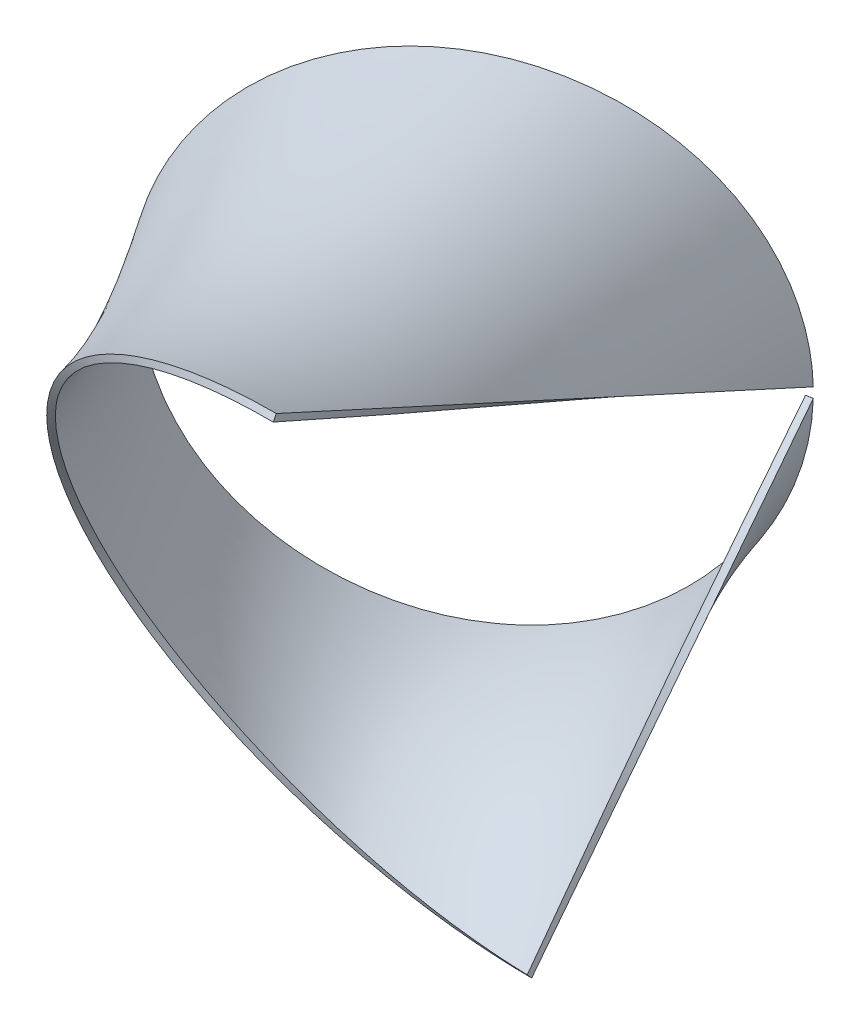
ISO-10303-21;
HEADER;
FILE_DESCRIPTION(('STEP AP214'),'2;1');
FILE_NAME('part.step','',(''),(''),'','','');
FILE_SCHEMA(('AUTOMOTIVE_DESIGN { 1 0 10303 214 1 1 1 1 }'));
ENDSEC;
DATA;
#1=APPLICATION_CONTEXT('core data for automotive mechanical design processes');
#2=APPLICATION_PROTOCOL_DEFINITION('international standard','automotive_design',2000,#1);
#3=PRODUCT_CONTEXT('',#1,'mechanical');
#4=PRODUCT('Part','Part','',(#3));
#5=PRODUCT_RELATED_PRODUCT_CATEGORY('part','',(#4));
#6=PRODUCT_DEFINITION_FORMATION('','',#4);
#7=PRODUCT_DEFINITION_CONTEXT('part definition',#1,'design');
#8=PRODUCT_DEFINITION('design','',#6,#7);
#9=PRODUCT_DEFINITION_SHAPE('','',#8);
#10=(LENGTH_UNIT() NAMED_UNIT(*) SI_UNIT(.MILLI.,.METRE.));
#11=(NAMED_UNIT(*) PLANE_ANGLE_UNIT() SI_UNIT($,.RADIAN.));
#12=(NAMED_UNIT(*) SI_UNIT($,.STERADIAN.) SOLID_ANGLE_UNIT());
#13=UNCERTAINTY_MEASURE_WITH_UNIT(LENGTH_MEASURE(1.E-05),#10,'distance_accuracy_value','');
#14=(GEOMETRIC_REPRESENTATION_CONTEXT(3) GLOBAL_UNCERTAINTY_ASSIGNED_CONTEXT((#13)) GLOBAL_UNIT_ASSIGNED_CONTEXT((#10,
#11,#12)) REPRESENTATION_CONTEXT('',''));
#15=CARTESIAN_POINT('',(0.,0.,0.));
#16=DIRECTION('',(0.,0.,1.));
#17=DIRECTION('',(1.,0.,0.));
#18=AXIS2_PLACEMENT_3D('',#15,#16,#17);
#19=CARTESIAN_POINT('',(-19.3218969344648,1.46343274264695,-139.780509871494));
#20=CARTESIAN_POINT('',(-19.6450967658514,20.7394955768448,-139.486989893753));
#21=CARTESIAN_POINT('',(-26.5307129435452,39.0460127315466,-135.384828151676));
#22=CARTESIAN_POINT('',(-44.4107239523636,59.1217329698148,-124.845367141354));
#23=CARTESIAN_POINT('',(-51.3897117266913,64.3134270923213,-120.745566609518));
#24=CARTESIAN_POINT('',(-66.5217618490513,71.3036766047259,-111.879844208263));
#25=CARTESIAN_POINT('',(-74.6739711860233,73.1017651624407,-107.113940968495));
#26=CARTESIAN_POINT('',(-99.5975381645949,72.8033919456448,-92.5777621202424));
#27=CARTESIAN_POINT('',(-115.495549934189,65.0289715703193,-83.3568354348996));
#28=CARTESIAN_POINT('',(-138.949504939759,37.6918922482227,-69.8483030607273));
#29=CARTESIAN_POINT('',(-145.562631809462,19.2373630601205,-66.1154863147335));
#30=CARTESIAN_POINT('',(-145.628094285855,-9.61868153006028,-66.2055894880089));
#31=CARTESIAN_POINT('',(-144.006014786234,-19.04442305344,-67.1827030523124));
#32=CARTESIAN_POINT('',(-137.818655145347,-36.5078032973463,-70.8137469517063));
#33=CARTESIAN_POINT('',(-133.253418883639,-44.5442066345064,-73.4674942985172));
#34=CARTESIAN_POINT('',(-121.533647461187,-58.2196984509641,-80.2430776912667));
#35=CARTESIAN_POINT('',(-114.615832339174,-63.5814833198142,-84.2266187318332));
#36=CARTESIAN_POINT('',(-99.5371183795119,-70.9318666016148,-92.8912121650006));
#37=CARTESIAN_POINT('',(-91.3774850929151,-72.9203822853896,-97.5719143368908));
#38=CARTESIAN_POINT('',(-74.6941312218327,-73.1067937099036,-107.151727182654));
#39=CARTESIAN_POINT('',(-66.5075304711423,-71.3008475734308,-111.856120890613));
#40=CARTESIAN_POINT('',(-51.3240362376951,-64.2949859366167,-120.613886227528));
#41=CARTESIAN_POINT('',(-44.3284952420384,-59.0954174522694,-124.667285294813));
#42=CARTESIAN_POINT('',(-32.4022775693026,-45.7038846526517,-131.637018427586));
#43=CARTESIAN_POINT('',(-27.710908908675,-37.7829741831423,-134.408371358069));
#44=CARTESIAN_POINT('',(-21.2339614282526,-20.4765061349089,-138.306814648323));
#45=CARTESIAN_POINT('',(-19.4482526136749,-11.0914797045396,-139.434593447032));
#46=CARTESIAN_POINT('',(-19.298875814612,-1.4622650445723,-139.623889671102));
#47=CARTESIAN_POINT('',(-17.3334997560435,1.5,-139.99249924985));
#48=CARTESIAN_POINT('',(-17.675765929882,21.2567942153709,-139.79489178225));
#49=CARTESIAN_POINT('',(-24.7574927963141,40.0607746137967,-135.706254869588));
#50=CARTESIAN_POINT('',(-43.1791344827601,60.7034527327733,-125.070515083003));
#51=CARTESIAN_POINT('',(-50.3718656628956,66.046279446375,-120.917789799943));
#52=CARTESIAN_POINT('',(-65.9651676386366,73.2420821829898,-111.914992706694));
#53=CARTESIAN_POINT('',(-74.365738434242,75.095058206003,-107.064920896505));
#54=CARTESIAN_POINT('',(-100.034417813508,74.7986321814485,-92.2451019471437));
#55=CARTESIAN_POINT('',(-116.38914900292,66.8098164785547,-82.8026934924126));
#56=CARTESIAN_POINT('',(-140.469702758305,38.7245114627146,-68.8997792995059));
#57=CARTESIAN_POINT('',(-147.224318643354,19.7607467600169,-64.9999999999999));
#58=CARTESIAN_POINT('',(-147.224318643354,-9.8803733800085,-64.9999999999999));
#59=CARTESIAN_POINT('',(-145.535664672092,-19.5615012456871,-65.9749448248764));
#60=CARTESIAN_POINT('',(-139.148287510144,-37.4942334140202,-69.6626987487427));
#61=CARTESIAN_POINT('',(-134.449564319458,-45.7458377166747,-72.3755078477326));
#62=CARTESIAN_POINT('',(-122.409287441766,-59.7884902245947,-79.326964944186));
#63=CARTESIAN_POINT('',(-115.31053542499,-65.2963572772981,-83.4254313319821));
#64=CARTESIAN_POINT('',(-99.844987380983,-72.8508325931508,-92.3544696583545));
#65=CARTESIAN_POINT('',(-91.4781913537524,-74.8974408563,-97.1850415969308));
#66=CARTESIAN_POINT('',(-74.3657384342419,-75.095058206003,-107.064920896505));
#67=CARTESIAN_POINT('',(-65.9651676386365,-73.2420821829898,-111.914992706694));
#68=CARTESIAN_POINT('',(-50.3718656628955,-66.046279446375,-120.917789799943));
#69=CARTESIAN_POINT('',(-43.1791344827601,-60.7034527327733,-125.070515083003));
#70=CARTESIAN_POINT('',(-30.8980400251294,-46.9416673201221,-132.16100827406));
#71=CARTESIAN_POINT('',(-26.0573346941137,-38.8002258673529,-134.955790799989));
#72=CARTESIAN_POINT('',(-19.3606311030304,-21.0185907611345,-138.822134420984));
#73=CARTESIAN_POINT('',(-17.5046328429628,-11.3783971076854,-139.89369551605));
#74=CARTESIAN_POINT('',(-17.3334997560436,-1.4999999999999,-139.99249924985));
#75=B_SPLINE_SURFACE_WITH_KNOTS('',1,3,((#19,#20,#21,#22,#23,#24,#25,#26,#27,#28,#29,#30,#31,
#32,#33,#34,#35,#36,#37,#38,#39,#40,#41,#42,#43,#44,#45,#46),(#47,#48,#49,#50,#51,#52,#53,#54,
#55,#56,#57,#58,#59,#60,#61,#62,#63,#64,#65,#66,#67,#68,#69,#70,#71,#72,#73,#74)),.UNSPECIFIED.,
.F.,.F.,.F.,(2,2),(4,2,2,2,2,2,2,2,2,2,2,2,2,4),(0.,1.),(0.,0.125,0.1875,0.25,0.375,0.5,0.5625,
0.625,0.6875,0.75,0.8125,0.875,0.9375,1.),.UNSPECIFIED.);
#76=CARTESIAN_POINT('',(-17.3334997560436,-1.49999999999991,-139.99249924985));
#77=CARTESIAN_POINT('',(-19.298875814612,-1.46226504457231,-139.623889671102));
#78=B_SPLINE_CURVE_WITH_KNOTS('',1,(#76,#77),.UNSPECIFIED.,.F.,.F.,(2,2),(0.,1.),.UNSPECIFIED.);
#79=CARTESIAN_POINT('',(-17.3334997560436,-1.4999999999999,-139.99249924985));
#80=VERTEX_POINT('',#79);
#81=CARTESIAN_POINT('',(-19.298875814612,-1.4622650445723,-139.623889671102));
#82=VERTEX_POINT('',#81);
#83=EDGE_CURVE('E14',#80,#82,#78,.T.);
#84=CARTESIAN_POINT('',(-17.3334997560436,-1.4999999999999,-139.99249924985));
#85=CARTESIAN_POINT('',(-17.5046328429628,-11.3783971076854,-139.89369551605));
#86=CARTESIAN_POINT('',(-19.3606311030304,-21.0185907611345,-138.822134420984));
#87=CARTESIAN_POINT('',(-26.0573346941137,-38.8002258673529,-134.955790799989));
#88=CARTESIAN_POINT('',(-30.8980400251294,-46.9416673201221,-132.16100827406));
#89=CARTESIAN_POINT('',(-43.1791344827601,-60.7034527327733,-125.070515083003));
#90=CARTESIAN_POINT('',(-50.3718656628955,-66.046279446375,-120.917789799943));
#91=CARTESIAN_POINT('',(-65.9651676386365,-73.2420821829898,-111.914992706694));
#92=CARTESIAN_POINT('',(-74.3657384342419,-75.095058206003,-107.064920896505));
#93=CARTESIAN_POINT('',(-91.4781913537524,-74.8974408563,-97.1850415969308));
#94=CARTESIAN_POINT('',(-99.844987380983,-72.8508325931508,-92.3544696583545));
#95=CARTESIAN_POINT('',(-115.31053542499,-65.2963572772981,-83.4254313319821));
#96=CARTESIAN_POINT('',(-122.409287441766,-59.7884902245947,-79.326964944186));
#97=CARTESIAN_POINT('',(-134.449564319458,-45.7458377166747,-72.3755078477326));
#98=CARTESIAN_POINT('',(-139.148287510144,-37.4942334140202,-69.6626987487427));
#99=CARTESIAN_POINT('',(-145.535664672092,-19.5615012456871,-65.9749448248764));
#100=CARTESIAN_POINT('',(-147.224318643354,-9.8803733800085,-64.9999999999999));
#101=CARTESIAN_POINT('',(-147.224318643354,19.7607467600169,-64.9999999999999));
#102=CARTESIAN_POINT('',(-140.469702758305,38.7245114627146,-68.8997792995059));
#103=CARTESIAN_POINT('',(-116.38914900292,66.8098164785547,-82.8026934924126));
#104=CARTESIAN_POINT('',(-100.034417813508,74.7986321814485,-92.2451019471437));
#105=CARTESIAN_POINT('',(-74.365738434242,75.095058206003,-107.064920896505));
#106=CARTESIAN_POINT('',(-65.9651676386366,73.2420821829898,-111.914992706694));
#107=CARTESIAN_POINT('',(-50.3718656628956,66.046279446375,-120.917789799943));
#108=CARTESIAN_POINT('',(-43.1791344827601,60.7034527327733,-125.070515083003));
#109=CARTESIAN_POINT('',(-24.7574927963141,40.0607746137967,-135.706254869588));
#110=CARTESIAN_POINT('',(-17.675765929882,21.2567942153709,-139.79489178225));
#111=CARTESIAN_POINT('',(-17.3334997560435,1.5,-139.99249924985));
#112=B_SPLINE_CURVE_WITH_KNOTS('',3,(#84,#85,#86,#87,#88,#89,#90,#91,#92,#93,#94,#95,#96,#97,
#98,#99,#100,#101,#102,#103,#104,#105,#106,#107,#108,#109,#110,#111),.UNSPECIFIED.,.F.,.F.,(4,2,
2,2,2,2,2,2,2,2,2,2,2,4),(0.,0.0625,0.125,0.1875,0.25,0.3125,0.375,0.4375,0.5,0.625,0.75,0.8125,
0.875,1.),.UNSPECIFIED.);
#113=CARTESIAN_POINT('',(-17.3334997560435,1.5,-139.99249924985));
#114=VERTEX_POINT('',#113);
#115=EDGE_CURVE('E240',#80,#114,#112,.T.);
#116=CARTESIAN_POINT('',(-17.3334997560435,1.5,-139.99249924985));
#117=CARTESIAN_POINT('',(-19.3218969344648,1.46343274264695,-139.780509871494));
#118=B_SPLINE_CURVE_WITH_KNOTS('',1,(#116,#117),.UNSPECIFIED.,.F.,.F.,(2,2),(0.,1.),.UNSPECIFIED.);
#119=CARTESIAN_POINT('',(-19.3218969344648,1.46343274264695,-139.780509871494));
#120=VERTEX_POINT('',#119);
#121=EDGE_CURVE('E73',#114,#120,#118,.T.);
#122=CARTESIAN_POINT('',(-19.2988758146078,-1.46226504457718,-139.623889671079));
#123=CARTESIAN_POINT('',(-19.3174748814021,-2.66297365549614,-139.600300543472));
#124=CARTESIAN_POINT('',(-19.3616285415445,-3.86299654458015,-139.562008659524));
#125=CARTESIAN_POINT('',(-19.5005857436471,-6.25345092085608,-139.456411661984));
#126=CARTESIAN_POINT('',(-19.595162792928,-7.44390132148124,-139.38923654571));
#127=CARTESIAN_POINT('',(-19.8342306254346,-9.81331654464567,-139.226355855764));
#128=CARTESIAN_POINT('',(-19.9785341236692,-10.9923076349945,-139.130757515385));
#129=CARTESIAN_POINT('',(-20.3162871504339,-13.3369095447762,-138.911524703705));
#130=CARTESIAN_POINT('',(-20.5095857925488,-14.5025501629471,-138.787976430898));
#131=CARTESIAN_POINT('',(-20.9445795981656,-16.8185533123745,-138.513322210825));
#132=CARTESIAN_POINT('',(-21.1861575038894,-17.9689457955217,-138.362283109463));
#133=CARTESIAN_POINT('',(-21.7169630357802,-20.2525518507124,-138.033118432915));
#134=CARTESIAN_POINT('',(-22.0061046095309,-21.3857924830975,-137.855041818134));
#135=CARTESIAN_POINT('',(-22.631295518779,-23.6331909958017,-137.472265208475));
#136=CARTESIAN_POINT('',(-22.9672879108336,-24.7473702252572,-137.267597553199));
#137=CARTESIAN_POINT('',(-23.6854411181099,-26.954739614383,-136.832095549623));
#138=CARTESIAN_POINT('',(-24.0675723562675,-28.0479427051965,-136.601277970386));
#139=CARTESIAN_POINT('',(-24.8772658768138,-30.2114518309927,-136.113927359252));
#140=CARTESIAN_POINT('',(-25.3048245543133,-31.2817596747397,-135.857396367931));
#141=CARTESIAN_POINT('',(-26.2046368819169,-33.397569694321,-135.319065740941));
#142=CARTESIAN_POINT('',(-26.6769118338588,-34.4430597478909,-135.037254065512));
#143=CARTESIAN_POINT('',(-27.6654217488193,-36.5073261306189,-134.448805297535));
#144=CARTESIAN_POINT('',(-28.1817021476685,-37.5260733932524,-134.14214256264));
#145=CARTESIAN_POINT('',(-29.2574891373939,-39.5349479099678,-133.504431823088));
#146=CARTESIAN_POINT('',(-29.8170647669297,-40.5250258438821,-133.173344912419));
#147=CARTESIAN_POINT('',(-30.9787101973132,-42.4746584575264,-132.487223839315));
#148=CARTESIAN_POINT('',(-31.5808722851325,-43.4341398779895,-132.13213774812));
#149=CARTESIAN_POINT('',(-32.8269601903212,-45.320680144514,-131.398452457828));
#150=CARTESIAN_POINT('',(-33.4710012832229,-46.2476376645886,-131.019788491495));
#151=CARTESIAN_POINT('',(-34.8001226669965,-48.0672365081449,-130.239385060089));
#152=CARTESIAN_POINT('',(-35.4853409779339,-48.9597438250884,-129.837568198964));
#153=CARTESIAN_POINT('',(-36.896086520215,-50.708551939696,-129.011272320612));
#154=CARTESIAN_POINT('',(-37.6217741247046,-51.5646809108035,-128.586703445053));
#155=CARTESIAN_POINT('',(-39.1089788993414,-53.2345989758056,-127.717611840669));
#156=CARTESIAN_POINT('',(-39.8704951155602,-54.0483891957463,-127.273089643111));
#157=CARTESIAN_POINT('',(-41.4242431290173,-55.6282084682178,-126.367149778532));
#158=CARTESIAN_POINT('',(-42.2163277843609,-56.39442892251,-125.9058135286));
#159=CARTESIAN_POINT('',(-43.8294833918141,-57.8783624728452,-124.967202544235));
#160=CARTESIAN_POINT('',(-44.6504396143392,-58.5962404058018,-124.489991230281));
#161=CARTESIAN_POINT('',(-46.3196163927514,-59.9827389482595,-123.520603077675));
#162=CARTESIAN_POINT('',(-47.1677501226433,-60.6514975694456,-123.028474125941));
#163=CARTESIAN_POINT('',(-48.8895541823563,-61.9390022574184,-122.030213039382));
#164=CARTESIAN_POINT('',(-49.7631615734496,-62.557859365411,-121.524115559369));
#165=CARTESIAN_POINT('',(-51.5341832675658,-63.7448027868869,-120.498877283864));
#166=CARTESIAN_POINT('',(-52.4315549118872,-64.3129730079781,-119.979759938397));
#167=CARTESIAN_POINT('',(-54.2483731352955,-65.397782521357,-118.929437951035));
#168=CARTESIAN_POINT('',(-55.1677941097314,-65.9144783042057,-118.398247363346));
#169=CARTESIAN_POINT('',(-57.0269777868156,-66.8955781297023,-117.324731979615));
#170=CARTESIAN_POINT('',(-57.9667290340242,-67.3600107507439,-116.782413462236));
#171=CARTESIAN_POINT('',(-59.8648397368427,-68.2358237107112,-115.687592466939));
#172=CARTESIAN_POINT('',(-60.8231992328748,-68.647203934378,-115.135089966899));
#173=CARTESIAN_POINT('',(-62.7567937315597,-69.4161525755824,-114.020848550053));
#174=CARTESIAN_POINT('',(-63.7320377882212,-69.7736910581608,-113.459104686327));
#175=CARTESIAN_POINT('',(-65.6976707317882,-70.4341982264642,-112.327325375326));
#176=CARTESIAN_POINT('',(-66.6880752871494,-70.7371056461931,-111.757281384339));
#177=CARTESIAN_POINT('',(-68.6823018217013,-71.2875945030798,-110.60984382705));
#178=CARTESIAN_POINT('',(-69.6861436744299,-71.5350814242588,-110.032439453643));
#179=CARTESIAN_POINT('',(-71.7055220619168,-71.9739749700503,-108.871220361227));
#180=CARTESIAN_POINT('',(-72.72108015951,-72.1652514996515,-108.287393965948));
#181=CARTESIAN_POINT('',(-74.7621738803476,-72.4909715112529,-107.114266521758));
#182=CARTESIAN_POINT('',(-75.7877300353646,-72.6252465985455,-106.524954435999));
#183=CARTESIAN_POINT('',(-77.8471109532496,-72.8362124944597,-105.341789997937));
#184=CARTESIAN_POINT('',(-78.8809522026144,-72.9126935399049,-104.747928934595));
#185=CARTESIAN_POINT('',(-80.9551985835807,-73.0073194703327,-103.556590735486));
#186=CARTESIAN_POINT('',(-81.9956127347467,-73.0252098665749,-102.959109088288));
#187=CARTESIAN_POINT('',(-84.0760197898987,-73.001965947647,-101.764523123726));
#188=CARTESIAN_POINT('',(-85.1160126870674,-72.9608307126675,-101.167418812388));
#189=CARTESIAN_POINT('',(-87.1885745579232,-72.8198656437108,-99.9775821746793));
#190=CARTESIAN_POINT('',(-88.2211562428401,-72.7202882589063,-99.3848420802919));
#191=CARTESIAN_POINT('',(-90.2771844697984,-72.4633021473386,-98.2046541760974));
#192=CARTESIAN_POINT('',(-91.3006504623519,-72.3061010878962,-97.6171950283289));
#193=CARTESIAN_POINT('',(-93.3367379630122,-71.9347258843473,-96.4484992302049));
#194=CARTESIAN_POINT('',(-94.3493822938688,-71.7207180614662,-95.8672494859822));
#195=CARTESIAN_POINT('',(-96.3621141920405,-71.2365829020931,-94.7119041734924));
#196=CARTESIAN_POINT('',(-97.3622249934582,-70.9665836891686,-94.1377953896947));
#197=CARTESIAN_POINT('',(-99.3481767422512,-70.3713163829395,-92.9976676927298));
#198=CARTESIAN_POINT('',(-100.33403866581,-70.0461410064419,-92.4316369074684));
#199=CARTESIAN_POINT('',(-102.289779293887,-69.3413702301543,-91.3086042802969));
#200=CARTESIAN_POINT('',(-103.259674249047,-68.9618345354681,-90.7515932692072));
#201=CARTESIAN_POINT('',(-105.181768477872,-68.1491912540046,-89.6475426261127));
#202=CARTESIAN_POINT('',(-106.133976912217,-67.7161123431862,-89.100497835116));
#203=CARTESIAN_POINT('',(-108.018987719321,-66.7972307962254,-88.0173250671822));
#204=CARTESIAN_POINT('',(-108.951789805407,-66.3114273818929,-87.4811972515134));
#205=CARTESIAN_POINT('',(-110.796280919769,-65.2879455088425,-86.4208064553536));
#206=CARTESIAN_POINT('',(-111.707957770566,-64.7502380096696,-85.8965503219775));
#207=CARTESIAN_POINT('',(-113.508496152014,-63.6237973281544,-84.8608530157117));
#208=CARTESIAN_POINT('',(-114.397330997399,-63.0350076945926,-84.3494268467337));
#209=CARTESIAN_POINT('',(-116.15048916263,-61.807252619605,-83.3403411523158));
#210=CARTESIAN_POINT('',(-117.014768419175,-61.1682038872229,-82.8427064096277));
#211=CARTESIAN_POINT('',(-118.717126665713,-59.8407805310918,-81.8621564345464));
#212=CARTESIAN_POINT('',(-119.555141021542,-59.152296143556,-81.3792775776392));
#213=CARTESIAN_POINT('',(-121.203289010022,-57.7268505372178,-80.4291924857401));
#214=CARTESIAN_POINT('',(-122.013333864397,-56.9897533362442,-79.962036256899));
#215=CARTESIAN_POINT('',(-123.603873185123,-55.4679294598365,-79.0443512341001));
#216=CARTESIAN_POINT('',(-124.384250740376,-54.683040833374,-78.593888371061));
#217=CARTESIAN_POINT('',(-125.913791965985,-53.0664772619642,-77.7105394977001));
#218=CARTESIAN_POINT('',(-126.662806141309,-52.2346147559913,-77.2777378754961));
#219=CARTESIAN_POINT('',(-128.124257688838,-50.5292932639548,-76.4328355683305));
#220=CARTESIAN_POINT('',(-128.836695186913,-49.6558344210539,-76.0207348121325));
#221=CARTESIAN_POINT('',(-130.220238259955,-47.8732449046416,-75.2199949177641));
#222=CARTESIAN_POINT('',(-130.891508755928,-46.9642842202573,-74.8312623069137));
#223=CARTESIAN_POINT('',(-132.192046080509,-45.1126878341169,-74.0776380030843));
#224=CARTESIAN_POINT('',(-132.821455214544,-44.1701849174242,-73.712665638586));
#225=CARTESIAN_POINT('',(-134.03760170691,-42.2535000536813,-73.0069514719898));
#226=CARTESIAN_POINT('',(-134.62445846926,-41.2794188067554,-72.6661419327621));
#227=CARTESIAN_POINT('',(-135.754831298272,-39.3015718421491,-72.0091456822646));
#228=CARTESIAN_POINT('',(-136.298443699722,-38.297879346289,-71.692904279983));
#229=CARTESIAN_POINT('',(-137.341660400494,-36.2628032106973,-71.0854403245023));
#230=CARTESIAN_POINT('',(-137.841337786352,-35.2314694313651,-70.7941762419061));
#231=CARTESIAN_POINT('',(-138.796019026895,-33.1431024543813,-70.2370655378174));
#232=CARTESIAN_POINT('',(-139.251072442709,-32.0860994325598,-69.9711907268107));
#233=CARTESIAN_POINT('',(-140.115843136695,-29.9483835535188,-69.4652593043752));
#234=CARTESIAN_POINT('',(-140.525585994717,-28.8676844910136,-69.2251881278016));
#235=CARTESIAN_POINT('',(-141.299076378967,-26.6845631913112,-68.7712663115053));
#236=CARTESIAN_POINT('',(-141.662824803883,-25.5821413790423,-68.5574151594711));
#237=CARTESIAN_POINT('',(-142.34367099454,-23.3575573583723,-68.1563369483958));
#238=CARTESIAN_POINT('',(-142.660743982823,-22.2353850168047,-67.9691240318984));
#239=CARTESIAN_POINT('',(-143.247588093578,-19.9732777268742,-67.6217267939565));
#240=CARTESIAN_POINT('',(-143.51730743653,-18.8333248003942,-67.461572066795));
#241=CARTESIAN_POINT('',(-144.008797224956,-16.5376279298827,-67.1686965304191));
#242=CARTESIAN_POINT('',(-144.230487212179,-15.3818608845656,-67.0360217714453));
#243=CARTESIAN_POINT('',(-144.625275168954,-13.0564998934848,-66.7985121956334));
#244=CARTESIAN_POINT('',(-144.798261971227,-11.8868805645,-66.6937410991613));
#245=CARTESIAN_POINT('',(-145.095004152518,-9.53577038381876,-66.5124460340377));
#246=CARTESIAN_POINT('',(-145.218615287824,-8.35425493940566,-66.4360048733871));
#247=CARTESIAN_POINT('',(-145.415968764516,-5.98129789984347,-66.3117768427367));
#248=CARTESIAN_POINT('',(-145.48953111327,-4.78983591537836,-66.2640934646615));
#249=CARTESIAN_POINT('',(-145.58615430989,-2.39892017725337,-66.1977936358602));
#250=CARTESIAN_POINT('',(-145.608996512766,-1.199454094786,-66.1793031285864));
#251=CARTESIAN_POINT('',(-145.603550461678,1.1994303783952,-66.1718071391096));
#252=CARTESIAN_POINT('',(-145.575263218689,2.39884876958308,-66.1828010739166));
#253=CARTESIAN_POINT('',(-145.467808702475,4.78957496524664,-66.2341786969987));
#254=CARTESIAN_POINT('',(-145.388861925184,5.980895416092,-66.2744351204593));
#255=CARTESIAN_POINT('',(-145.180852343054,8.35347927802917,-66.3839409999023));
#256=CARTESIAN_POINT('',(-145.051971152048,9.53476345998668,-66.4530854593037));
#257=CARTESIAN_POINT('',(-144.744847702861,11.8853270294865,-66.6199698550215));
#258=CARTESIAN_POINT('',(-144.566751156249,13.0546314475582,-66.7176254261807));
#259=CARTESIAN_POINT('',(-144.161947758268,15.3792863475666,-66.9411379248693));
#260=CARTESIAN_POINT('',(-143.93535343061,16.534662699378,-67.0669296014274));
#261=CARTESIAN_POINT('',(-143.434300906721,18.829511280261,-67.3463215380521));
#262=CARTESIAN_POINT('',(-143.159924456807,19.9690071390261,-67.4998743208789));
#263=CARTESIAN_POINT('',(-142.564050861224,22.2301440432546,-67.834396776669));
#264=CARTESIAN_POINT('',(-142.242606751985,23.3518036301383,-68.0153355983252));
#265=CARTESIAN_POINT('',(-141.553338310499,25.5753175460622,-68.4042389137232));
#266=CARTESIAN_POINT('',(-141.185540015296,26.677182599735,-68.6121882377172));
#267=CARTESIAN_POINT('',(-140.404301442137,28.8591581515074,-69.0547214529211));
#268=CARTESIAN_POINT('',(-139.990861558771,29.9392688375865,-69.2893051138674));
#269=CARTESIAN_POINT('',(-139.119076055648,32.0757885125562,-69.7847157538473));
#270=CARTESIAN_POINT('',(-138.660706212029,33.1321843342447,-70.0455568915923));
#271=CARTESIAN_POINT('',(-137.699795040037,35.2193303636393,-70.593090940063));
#272=CARTESIAN_POINT('',(-137.197205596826,36.2500510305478,-70.8798120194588));
#273=CARTESIAN_POINT('',(-136.148587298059,38.2839071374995,-71.478714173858));
#274=CARTESIAN_POINT('',(-135.602486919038,39.2869933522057,-71.7909371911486));
#275=CARTESIAN_POINT('',(-134.467576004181,41.2636462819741,-72.4404510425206));
#276=CARTESIAN_POINT('',(-133.878670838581,42.2371404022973,-72.7777974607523));
#277=CARTESIAN_POINT('',(-132.658876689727,44.1526811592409,-73.4771667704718));
#278=CARTESIAN_POINT('',(-132.027870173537,45.0946277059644,-73.8392588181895));
#279=CARTESIAN_POINT('',(-130.724593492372,46.9451523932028,-74.5877253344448));
#280=CARTESIAN_POINT('',(-130.052183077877,47.8535983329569,-74.9741824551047));
#281=CARTESIAN_POINT('',(-128.666820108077,49.6352086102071,-75.7709971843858));
#282=CARTESIAN_POINT('',(-127.95370490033,50.5082035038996,-76.1814508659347));
#283=CARTESIAN_POINT('',(-126.49135080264,52.2126593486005,-77.0236871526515));
#284=CARTESIAN_POINT('',(-125.742111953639,53.0441203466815,-77.4554697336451));
#285=CARTESIAN_POINT('',(-124.212566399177,54.6599560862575,-78.3374098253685));
#286=CARTESIAN_POINT('',(-123.432407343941,55.4445181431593,-78.7874802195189));
#287=CARTESIAN_POINT('',(-121.842741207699,56.965770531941,-79.7050162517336));
#288=CARTESIAN_POINT('',(-121.033349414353,57.7026224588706,-80.1724137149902));
#289=CARTESIAN_POINT('',(-119.386928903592,59.1276643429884,-81.1236139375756));
#290=CARTESIAN_POINT('',(-118.549987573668,59.815989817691,-81.6073649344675));
#291=CARTESIAN_POINT('',(-116.850179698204,61.1431852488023,-82.5902861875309));
#292=CARTESIAN_POINT('',(-115.9873766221,61.782164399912,-83.0894187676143));
#293=CARTESIAN_POINT('',(-114.23755535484,63.0098714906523,-84.1021170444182));
#294=CARTESIAN_POINT('',(-113.350580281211,63.598682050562,-84.615657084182));
#295=CARTESIAN_POINT('',(-111.554124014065,64.7252553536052,-85.6561849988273));
#296=CARTESIAN_POINT('',(-110.644668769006,65.263073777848,-86.1831573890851));
#297=CARTESIAN_POINT('',(-108.804959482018,66.2868664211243,-87.2495653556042));
#298=CARTESIAN_POINT('',(-107.874717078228,66.7728688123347,-87.7889939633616));
#299=CARTESIAN_POINT('',(-105.995138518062,67.6922342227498,-88.8793305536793));
#300=CARTESIAN_POINT('',(-105.045802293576,68.1255970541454,-89.4302385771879));
#301=CARTESIAN_POINT('',(-103.129737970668,68.9388902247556,-90.5425512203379));
#302=CARTESIAN_POINT('',(-102.163000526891,69.3187908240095,-91.1039614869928));
#303=CARTESIAN_POINT('',(-100.213831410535,70.0243690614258,-92.2362971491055));
#304=CARTESIAN_POINT('',(-99.2313834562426,70.3499858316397,-92.8072324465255));
#305=CARTESIAN_POINT('',(-97.2524855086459,70.9462089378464,-93.9576383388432));
#306=CARTESIAN_POINT('',(-96.2560146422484,71.216721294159,-94.5371217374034));
#307=CARTESIAN_POINT('',(-94.2507562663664,71.7019511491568,-95.7036459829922));
#308=CARTESIAN_POINT('',(-93.2419457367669,71.9165391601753,-96.2907011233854));
#309=CARTESIAN_POINT('',(-91.2136852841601,72.2891386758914,-97.4713933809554));
#310=CARTESIAN_POINT('',(-90.1942128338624,72.4469823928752,-98.0650447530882));
#311=CARTESIAN_POINT('',(-88.1462961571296,72.7053138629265,-99.2579566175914));
#312=CARTESIAN_POINT('',(-87.1178328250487,72.80559238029,-99.8572296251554));
#313=CARTESIAN_POINT('',(-85.0535915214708,72.9480151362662,-101.060415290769));
#314=CARTESIAN_POINT('',(-84.0178011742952,72.9899052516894,-101.664336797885));
#315=CARTESIAN_POINT('',(-81.9458338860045,73.0147098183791,-102.87277010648));
#316=CARTESIAN_POINT('',(-80.9096569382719,72.9976232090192,-103.47728191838));
#317=CARTESIAN_POINT('',(-78.8438710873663,72.9046503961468,-104.68282296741));
#318=CARTESIAN_POINT('',(-77.8142530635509,72.8290164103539,-105.283856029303));
#319=CARTESIAN_POINT('',(-75.7632630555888,72.6197841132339,-106.481445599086));
#320=CARTESIAN_POINT('',(-74.7418747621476,72.4863932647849,-107.078010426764));
#321=CARTESIAN_POINT('',(-72.7090241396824,72.1624758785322,-108.265670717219));
#322=CARTESIAN_POINT('',(-71.6975416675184,71.9721154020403,-108.856776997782));
#323=CARTESIAN_POINT('',(-69.6861846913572,71.5350821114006,-110.032528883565));
#324=CARTESIAN_POINT('',(-68.6862891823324,71.2885370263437,-110.617186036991));
#325=CARTESIAN_POINT('',(-66.6997895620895,70.7399535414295,-111.779049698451));
#326=CARTESIAN_POINT('',(-65.7131662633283,70.4380072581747,-112.356266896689));
#327=CARTESIAN_POINT('',(-63.7548952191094,69.7794368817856,-113.502262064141));
#328=CARTESIAN_POINT('',(-62.7832325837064,69.4228716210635,-114.07104840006));
#329=CARTESIAN_POINT('',(-60.8565668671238,68.655875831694,-115.199194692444));
#330=CARTESIAN_POINT('',(-59.9015555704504,68.2454727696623,-115.758559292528));
#331=CARTESIAN_POINT('',(-58.0098754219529,67.3716112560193,-116.866876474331));
#332=CARTESIAN_POINT('',(-57.0732073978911,66.9081504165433,-117.415828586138));
#333=CARTESIAN_POINT('',(-55.2198945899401,65.9289805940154,-118.502336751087));
#334=CARTESIAN_POINT('',(-54.3032621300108,65.4132404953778,-119.039885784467));
#335=CARTESIAN_POINT('',(-52.4916981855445,64.3303165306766,-120.10260540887));
#336=CARTESIAN_POINT('',(-51.5967931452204,63.76307360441,-120.627760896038));
#337=CARTESIAN_POINT('',(-49.8303578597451,62.5779450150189,-121.664712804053));
#338=CARTESIAN_POINT('',(-48.9588710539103,61.9599728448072,-122.176484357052));
#339=CARTESIAN_POINT('',(-47.2409413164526,60.6741826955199,-123.185689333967));
#340=CARTESIAN_POINT('',(-46.3945620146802,60.0062510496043,-123.68308625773));
#341=CARTESIAN_POINT('',(-44.7285113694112,58.6213340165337,-124.662565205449));
#342=CARTESIAN_POINT('',(-43.9089274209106,57.9042079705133,-125.144597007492));
#343=CARTESIAN_POINT('',(-42.2981250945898,56.4216877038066,-126.092368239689));
#344=CARTESIAN_POINT('',(-41.5070218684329,55.6561259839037,-126.558041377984));
#345=CARTESIAN_POINT('',(-39.9548363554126,54.0775144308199,-127.472127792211));
#346=CARTESIAN_POINT('',(-39.1939014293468,53.2642705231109,-127.920456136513));
#347=CARTESIAN_POINT('',(-37.7074800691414,51.5953156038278,-128.796620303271));
#348=CARTESIAN_POINT('',(-36.9819964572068,50.7396012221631,-129.224454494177));
#349=CARTESIAN_POINT('',(-35.5713126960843,48.9914765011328,-130.056739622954));
#350=CARTESIAN_POINT('',(-34.8859554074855,48.0992363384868,-130.461281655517));
#351=CARTESIAN_POINT('',(-33.5562277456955,46.2800145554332,-131.246568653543));
#352=CARTESIAN_POINT('',(-32.9117222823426,45.3531654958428,-131.627391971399));
#353=CARTESIAN_POINT('',(-31.6644060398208,43.4666776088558,-132.364819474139));
#354=CARTESIAN_POINT('',(-31.0614825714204,42.5071388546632,-132.721489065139));
#355=CARTESIAN_POINT('',(-29.8980450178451,40.5572234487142,-133.410189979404));
#356=CARTESIAN_POINT('',(-29.3374408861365,39.5669189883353,-133.742273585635));
#357=CARTESIAN_POINT('',(-28.259361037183,37.5574239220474,-134.381383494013));
#358=CARTESIAN_POINT('',(-27.74181816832,36.5382817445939,-134.688448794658));
#359=CARTESIAN_POINT('',(-26.750583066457,34.4730630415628,-135.277104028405));
#360=CARTESIAN_POINT('',(-26.2768469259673,33.4270148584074,-135.558719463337));
#361=CARTESIAN_POINT('',(-25.3739493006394,31.3099356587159,-136.096057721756));
#362=CARTESIAN_POINT('',(-24.9447676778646,30.2389161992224,-136.351792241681));
#363=CARTESIAN_POINT('',(-24.1317037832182,28.073845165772,-136.836952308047));
#364=CARTESIAN_POINT('',(-23.7478259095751,26.9797913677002,-137.066375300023));
#365=CARTESIAN_POINT('',(-23.026093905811,24.7706008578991,-137.498496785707));
#366=CARTESIAN_POINT('',(-22.6882697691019,23.655450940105,-137.701177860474));
#367=CARTESIAN_POINT('',(-22.0593686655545,21.4060150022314,-138.079400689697));
#368=CARTESIAN_POINT('',(-21.7683486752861,20.2717074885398,-138.25490935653));
#369=CARTESIAN_POINT('',(-21.2337775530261,17.9858998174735,-138.57837324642));
#370=CARTESIAN_POINT('',(-20.9903121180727,16.8343725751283,-138.726278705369));
#371=CARTESIAN_POINT('',(-20.5515707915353,14.5160644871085,-138.994121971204));
#372=CARTESIAN_POINT('',(-20.3564114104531,13.3492537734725,-139.113992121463));
#373=CARTESIAN_POINT('',(-20.0149981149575,11.0023124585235,-139.325352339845));
#374=CARTESIAN_POINT('',(-19.8688939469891,9.82215223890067,-139.416755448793));
#375=CARTESIAN_POINT('',(-19.6263164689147,7.45043879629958,-139.570762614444));
#376=CARTESIAN_POINT('',(-19.5300289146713,6.25885956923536,-139.633258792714));
#377=CARTESIAN_POINT('',(-19.3877674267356,3.86622912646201,-139.729056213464));
#378=CARTESIAN_POINT('',(-19.3420180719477,2.66515933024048,-139.76222701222));
#379=CARTESIAN_POINT('',(-19.3218969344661,1.46343274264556,-139.780509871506));
#380=B_SPLINE_CURVE_WITH_KNOTS('',3,(#122,#123,#124,#125,#126,#127,#128,#129,#130,#131,#132,
#133,#134,#135,#136,#137,#138,#139,#140,#141,#142,#143,#144,#145,#146,#147,#148,#149,#150,#151,
#152,#153,#154,#155,#156,#157,#158,#159,#160,#161,#162,#163,#164,#165,#166,#167,#168,#169,#170,
#171,#172,#173,#174,#175,#176,#177,#178,#179,#180,#181,#182,#183,#184,#185,#186,#187,#188,#189,
#190,#191,#192,#193,#194,#195,#196,#197,#198,#199,#200,#201,#202,#203,#204,#205,#206,#207,#208,
#209,#210,#211,#212,#213,#214,#215,#216,#217,#218,#219,#220,#221,#222,#223,#224,#225,#226,#227,
#228,#229,#230,#231,#232,#233,#234,#235,#236,#237,#238,#239,#240,#241,#242,#243,#244,#245,#246,
#247,#248,#249,#250,#251,#252,#253,#254,#255,#256,#257,#258,#259,#260,#261,#262,#263,#264,#265,
#266,#267,#268,#269,#270,#271,#272,#273,#274,#275,#276,#277,#278,#279,#280,#281,#282,#283,#284,
#285,#286,#287,#288,#289,#290,#291,#292,#293,#294,#295,#296,#297,#298,#299,#300,#301,#302,#303,
#304,#305,#306,#307,#308,#309,#310,#311,#312,#313,#314,#315,#316,#317,#318,#319,#320,#321,#322,
#323,#324,#325,#326,#327,#328,#329,#330,#331,#332,#333,#334,#335,#336,#337,#338,#339,#340,#341,
#342,#343,#344,#345,#346,#347,#348,#349,#350,#351,#352,#353,#354,#355,#356,#357,#358,#359,#360,
#361,#362,#363,#364,#365,#366,#367,#368,#369,#370,#371,#372,#373,#374,#375,#376,#377,#378,#379),
.UNSPECIFIED.,.F.,.F.,(4,2,2,2,2,2,2,2,2,2,2,2,2,2,2,2,2,2,2,2,2,2,2,2,2,2,2,2,2,2,2,2,2,2,2,2,
2,2,2,2,2,2,2,2,2,2,2,2,2,2,2,2,2,2,2,2,2,2,2,2,2,2,2,2,2,2,2,2,2,2,2,2,2,2,2,2,2,2,2,2,2,2,2,2,
2,2,2,2,2,2,2,2,2,2,2,2,2,2,2,2,2,2,2,2,2,2,2,2,2,2,2,2,2,2,2,2,2,2,2,2,2,2,2,2,2,2,2,2,4),(0.,
3.60289029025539,7.18973174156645,10.7632090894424,14.325812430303,17.8798660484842,
21.4275589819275,24.9709769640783,28.5121353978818,32.0530130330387,35.595586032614,
39.1418621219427,42.6939145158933,46.2539153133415,49.8241680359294,53.407138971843,
57.0054869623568,60.6037392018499,64.1864239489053,67.75619930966,71.315527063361,
74.8667024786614,78.4118857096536,81.9531344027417,85.492437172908,89.0317476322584,
92.573018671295,96.1182367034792,99.6694555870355,103.228829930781,106.798647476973,
110.381360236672,113.979614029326,117.577923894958,121.160803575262,124.73089602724,
128.290648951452,131.842344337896,135.388129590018,138.930049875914,142.470081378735,
146.01016513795,149.552241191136,153.098282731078,156.6503299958,160.210523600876,
163.781137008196,167.364607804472,170.963567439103,174.562514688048,178.145948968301,
181.716502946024,185.276615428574,188.828561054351,192.374481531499,195.916418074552,
199.456344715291,202.996202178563,206.537932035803,210.083510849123,213.634984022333,
217.194499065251,220.764337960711,224.346948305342,227.944972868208,231.542926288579,
235.125324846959,238.694814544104,242.253847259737,245.804710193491,249.349556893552,
252.890439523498,256.429342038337,259.968213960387,263.50900446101,267.0536964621,
270.604340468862,274.163087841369,277.732223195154,281.31419560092,284.91164823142,
288.50909678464,292.091056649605,295.660170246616,299.218885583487,302.769485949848,
306.314121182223,309.854840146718,313.393624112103,316.932420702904,320.473178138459,
324.0178794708,327.568576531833,331.127423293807,334.696708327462,338.278886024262,
341.876606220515,345.474391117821,349.056762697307,352.626371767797,356.1856754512,
359.736966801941,363.282406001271,366.824052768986,370.363899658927,373.903905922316,
377.446031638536,380.992271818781,384.544690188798,388.105452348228,391.67685799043,
395.26137184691,398.8616529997,402.462220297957,406.047586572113,409.620400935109,
413.183117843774,416.738026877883,420.287284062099,423.832944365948,427.376995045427,
430.921389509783,434.46808141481,438.019058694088,441.576377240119,445.142193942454,
448.718798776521,452.308645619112,455.914381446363),.UNSPECIFIED.);
#381=EDGE_CURVE('E126',#82,#120,#380,.T.);
#382=ORIENTED_EDGE('',*,*,#83,.F.);
#383=ORIENTED_EDGE('',*,*,#115,.T.);
#384=ORIENTED_EDGE('',*,*,#121,.T.);
#385=ORIENTED_EDGE('',*,*,#381,.F.);
#386=EDGE_LOOP('',(#382,#383,#384,#385));
#387=FACE_BOUND('',#386,.T.);
#388=ADVANCED_FACE('F59',(#387),#75,.F.);
#389=CARTESIAN_POINT('',(-19.3218969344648,1.46343274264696,-139.780509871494));
#390=CARTESIAN_POINT('',(-17.869400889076,8.92578980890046,-124.86930538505));
#391=CARTESIAN_POINT('',(-16.4055102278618,16.3608523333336,-109.945283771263));
#392=CARTESIAN_POINT('',(-14.1472982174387,27.4592831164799,-87.5377076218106));
#393=CARTESIAN_POINT('',(-13.3836026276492,31.1498218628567,-80.0650239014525));
#394=CARTESIAN_POINT('',(-11.82291174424,38.5182912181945,-65.1164660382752));
#395=CARTESIAN_POINT('',(-11.0255176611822,42.1961580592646,-57.6405981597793));
#396=CARTESIAN_POINT('',(-9.39103254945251,49.5551952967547,-42.6944067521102));
#397=CARTESIAN_POINT('',(-8.55366000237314,53.2368150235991,-35.2243396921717));
#398=CARTESIAN_POINT('',(-6.85063232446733,60.625728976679,-20.3000460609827));
#399=CARTESIAN_POINT('',(-5.98551486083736,64.3335543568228,-12.8460380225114));
#400=CARTESIAN_POINT('',(-4.25415785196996,71.7860517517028,2.043082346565));
#401=CARTESIAN_POINT('',(-3.38853696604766,75.5305170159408,9.47836024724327));
#402=CARTESIAN_POINT('',(-1.67762028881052,83.0494543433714,24.3355931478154));
#403=CARTESIAN_POINT('',(-0.832276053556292,86.8235141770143,31.7577565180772));
#404=CARTESIAN_POINT('',(0.,90.6061809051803,39.1767964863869));
#405=CARTESIAN_POINT('',(-17.3334997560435,1.50000000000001,-139.99249924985));
#406=CARTESIAN_POINT('',(-15.8890414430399,9.07399610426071,-125.137429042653));
#407=CARTESIAN_POINT('',(-14.4445831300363,16.6479922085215,-110.282358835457));
#408=CARTESIAN_POINT('',(-12.2778956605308,28.0089863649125,-87.9997535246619));
#409=CARTESIAN_POINT('',(-11.555666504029,31.7959844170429,-80.5722184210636));
#410=CARTESIAN_POINT('',(-10.1112081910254,39.3699805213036,-65.717148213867));
#411=CARTESIAN_POINT('',(-9.38897903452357,43.156978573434,-58.2896131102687));
#412=CARTESIAN_POINT('',(-7.94452072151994,50.7309746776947,-43.4345429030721));
#413=CARTESIAN_POINT('',(-7.22229156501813,54.517972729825,-36.0070077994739));
#414=CARTESIAN_POINT('',(-5.7778332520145,62.0919688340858,-21.1519375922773));
#415=CARTESIAN_POINT('',(-5.05560409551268,65.8789668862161,-13.724402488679));
#416=CARTESIAN_POINT('',(-3.61114578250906,73.4529629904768,1.1306677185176));
#417=CARTESIAN_POINT('',(-2.88891662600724,77.2399610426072,8.5582028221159));
#418=CARTESIAN_POINT('',(-1.44445831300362,84.8139571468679,23.4132730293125));
#419=CARTESIAN_POINT('',(-0.722229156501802,88.6009551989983,30.8408081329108));
#420=CARTESIAN_POINT('',(0.,92.3879532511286,38.268343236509));
#421=B_SPLINE_SURFACE_WITH_KNOTS('',1,3,((#389,#390,#391,#392,#393,#394,#395,#396,#397,#398,
#399,#400,#401,#402,#403,#404),(#405,#406,#407,#408,#409,#410,#411,#412,#413,#414,#415,#416,
#417,#418,#419,#420)),.UNSPECIFIED.,.F.,.F.,.F.,(2,2),(4,2,2,2,2,2,2,4),(0.,1.),
(-0.100421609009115,-0.0502108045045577,-0.0251054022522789,0.,0.0251054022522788,
0.0502108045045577,0.0753162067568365,0.100421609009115),.UNSPECIFIED.);
#422=CARTESIAN_POINT('',(-17.3334997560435,1.50000000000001,-139.99249924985));
#423=CARTESIAN_POINT('',(-15.8890414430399,9.07399610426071,-125.137429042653));
#424=CARTESIAN_POINT('',(-14.4445831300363,16.6479922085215,-110.282358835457));
#425=CARTESIAN_POINT('',(-12.2778956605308,28.0089863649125,-87.9997535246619));
#426=CARTESIAN_POINT('',(-11.555666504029,31.7959844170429,-80.5722184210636));
#427=CARTESIAN_POINT('',(-10.1112081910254,39.3699805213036,-65.717148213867));
#428=CARTESIAN_POINT('',(-9.38897903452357,43.156978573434,-58.2896131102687));
#429=CARTESIAN_POINT('',(-7.94452072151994,50.7309746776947,-43.4345429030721));
#430=CARTESIAN_POINT('',(-7.22229156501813,54.517972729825,-36.0070077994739));
#431=CARTESIAN_POINT('',(-5.7778332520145,62.0919688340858,-21.1519375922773));
#432=CARTESIAN_POINT('',(-5.05560409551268,65.8789668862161,-13.724402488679));
#433=CARTESIAN_POINT('',(-3.61114578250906,73.4529629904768,1.1306677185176));
#434=CARTESIAN_POINT('',(-2.88891662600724,77.2399610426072,8.5582028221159));
#435=CARTESIAN_POINT('',(-1.44445831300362,84.8139571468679,23.4132730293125));
#436=CARTESIAN_POINT('',(-0.722229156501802,88.6009551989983,30.8408081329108));
#437=CARTESIAN_POINT('',(0.,92.3879532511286,38.268343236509));
#438=B_SPLINE_CURVE_WITH_KNOTS('',3,(#422,#423,#424,#425,#426,#427,#428,#429,#430,#431,#432,
#433,#434,#435,#436,#437),.UNSPECIFIED.,.F.,.F.,(4,2,2,2,2,2,2,4),(-0.100421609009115,
-0.0502108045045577,-0.0251054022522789,0.,0.0251054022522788,0.0502108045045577,
0.0753162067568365,0.100421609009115),.UNSPECIFIED.);
#439=CARTESIAN_POINT('',(0.,92.3879532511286,38.2683432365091));
#440=VERTEX_POINT('',#439);
#441=EDGE_CURVE('E109',#114,#440,#438,.T.);
#442=CARTESIAN_POINT('',(0.,92.3879532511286,38.268343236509));
#443=CARTESIAN_POINT('',(0.,90.6061809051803,39.1767964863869));
#444=B_SPLINE_CURVE_WITH_KNOTS('',1,(#442,#443),.UNSPECIFIED.,.F.,.F.,(2,2),(0.,1.),.UNSPECIFIED.);
#445=CARTESIAN_POINT('',(0.,90.6061809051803,39.176796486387));
#446=VERTEX_POINT('',#445);
#447=EDGE_CURVE('E103',#440,#446,#444,.T.);
#448=CARTESIAN_POINT('',(-19.3218969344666,1.46343274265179,-139.780509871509));
#449=CARTESIAN_POINT('',(-18.9587509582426,3.32903004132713,-136.052696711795));
#450=CARTESIAN_POINT('',(-18.5948018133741,5.19297217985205,-132.324133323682));
#451=CARTESIAN_POINT('',(-17.8645511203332,8.91717210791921,-124.865356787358));
#452=CARTESIAN_POINT('',(-17.4982495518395,10.7774298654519,-121.135143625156));
#453=CARTESIAN_POINT('',(-16.3946933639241,16.3521336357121,-109.941768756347));
#454=CARTESIAN_POINT('',(-15.6528002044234,20.0604433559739,-102.476005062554));
#455=CARTESIAN_POINT('',(-14.1472448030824,27.4592972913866,-87.5375353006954));
#456=CARTESIAN_POINT('',(-13.3835818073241,31.1498408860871,-80.0648290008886));
#457=CARTESIAN_POINT('',(-12.2130816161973,36.676226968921,-68.8535759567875));
#458=CARTESIAN_POINT('',(-11.8187403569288,38.5168153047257,-65.1160624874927));
#459=CARTESIAN_POINT('',(-11.0206463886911,42.1966683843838,-57.6412775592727));
#460=CARTESIAN_POINT('',(-10.6168934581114,44.0359330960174,-53.9040061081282));
#461=CARTESIAN_POINT('',(-9.79964829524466,47.7154583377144,-46.430921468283));
#462=CARTESIAN_POINT('',(-9.3861558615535,49.5557188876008,-42.6951083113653));
#463=CARTESIAN_POINT('',(-8.55028085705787,53.2400132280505,-35.2262729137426));
#464=CARTESIAN_POINT('',(-8.12789816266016,55.0840470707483,-31.4932507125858));
#465=CARTESIAN_POINT('',(-7.27639248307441,58.7785042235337,-24.0311203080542));
#466=CARTESIAN_POINT('',(-6.84726947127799,60.6289275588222,-20.3020121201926));
#467=CARTESIAN_POINT('',(-5.98541033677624,64.3380091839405,-12.8483442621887));
#468=CARTESIAN_POINT('',(-5.55267423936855,66.1966674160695,-9.12378456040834));
#469=CARTESIAN_POINT('',(-4.68700549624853,69.9229084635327,-1.67923150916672));
#470=CARTESIAN_POINT('',(-4.25407285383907,71.7904911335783,2.04076191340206));
#471=CARTESIAN_POINT('',(-3.39097176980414,75.5341528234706,9.47668869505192));
#472=CARTESIAN_POINT('',(-2.96080326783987,77.4102316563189,13.192622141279));
#473=CARTESIAN_POINT('',(-2.10536413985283,81.1696950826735,20.621243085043));
#474=CARTESIAN_POINT('',(-1.68009339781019,83.0530795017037,24.333930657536));
#475=CARTESIAN_POINT('',(-0.835412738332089,86.8256474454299,31.7569189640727));
#476=CARTESIAN_POINT('',(-0.416002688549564,88.7148308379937,35.4672197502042));
#477=CARTESIAN_POINT('',(3.88592431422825E-11,90.6061809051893,39.1767964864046));
#478=B_SPLINE_CURVE_WITH_KNOTS('',3,(#448,#449,#450,#451,#452,#453,#454,#455,#456,#457,#458,
#459,#460,#461,#462,#463,#464,#465,#466,#467,#468,#469,#470,#471,#472,#473,#474,#475,#476,#477),
.UNSPECIFIED.,.F.,.F.,(4,2,2,2,2,2,2,2,2,2,2,2,2,2,4),(0.,12.5530975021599,25.1063035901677,
50.2131649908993,75.3208969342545,87.8751895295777,100.429778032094,112.984626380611,
125.539649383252,138.094721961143,150.649706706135,163.204487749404,175.758993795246,
188.313201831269,200.867125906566),.UNSPECIFIED.);
#479=EDGE_CURVE('E107',#120,#446,#478,.T.);
#480=ORIENTED_EDGE('',*,*,#121,.F.);
#481=ORIENTED_EDGE('',*,*,#441,.T.);
#482=ORIENTED_EDGE('',*,*,#447,.T.);
#483=ORIENTED_EDGE('',*,*,#479,.F.);
#484=EDGE_LOOP('',(#480,#481,#482,#483));
#485=FACE_BOUND('',#484,.T.);
#486=ADVANCED_FACE('F106',(#485),#421,.T.);
#487=CARTESIAN_POINT('',(0.,90.6061809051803,39.176796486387));
#488=CARTESIAN_POINT('',(-13.0892987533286,90.5199058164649,39.0075829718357));
#489=CARTESIAN_POINT('',(-25.8491033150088,88.0485584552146,37.8188259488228));
#490=CARTESIAN_POINT('',(-43.4987144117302,81.2251269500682,34.6660742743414));
#491=CARTESIAN_POINT('',(-49.1345244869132,78.4319346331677,33.3902934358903));
#492=CARTESIAN_POINT('',(-59.7527665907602,71.8805775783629,30.4160768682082));
#493=CARTESIAN_POINT('',(-64.7351912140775,68.1226333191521,28.7176947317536));
#494=CARTESIAN_POINT('',(-73.8943966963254,59.708754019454,24.9266070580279));
#495=CARTESIAN_POINT('',(-77.9777159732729,55.1388539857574,22.8744695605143));
#496=CARTESIAN_POINT('',(-85.0970974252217,45.4170817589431,18.5262495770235));
#497=CARTESIAN_POINT('',(-88.1334514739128,40.2650973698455,16.2302115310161));
#498=CARTESIAN_POINT('',(-93.0930149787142,29.5139601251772,11.4663552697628));
#499=CARTESIAN_POINT('',(-95.0152272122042,23.9121896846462,9.00223745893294));
#500=CARTESIAN_POINT('',(-97.6534491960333,12.3923611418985,3.98123582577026));
#501=CARTESIAN_POINT('',(-98.3691040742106,6.47386654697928,1.42430114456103));
#502=CARTESIAN_POINT('',(-98.4866522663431,-5.52764495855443,-3.70868213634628));
#503=CARTESIAN_POINT('',(-97.8856098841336,-11.4874175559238,-6.23149015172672));
#504=CARTESIAN_POINT('',(-95.4107028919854,-23.1448172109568,-11.1171624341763));
#505=CARTESIAN_POINT('',(-93.5365267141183,-28.841715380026,-13.480058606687));
#506=CARTESIAN_POINT('',(-88.587165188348,-39.7878790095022,-17.962707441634));
#507=CARTESIAN_POINT('',(-85.5141766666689,-45.0363810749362,-20.0835026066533));
#508=CARTESIAN_POINT('',(-78.2786155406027,-54.9201952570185,-24.0152434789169));
#509=CARTESIAN_POINT('',(-74.1171777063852,-59.5558660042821,-25.8259532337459));
#510=CARTESIAN_POINT('',(-64.8124442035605,-68.0740422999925,-29.0887885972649));
#511=CARTESIAN_POINT('',(-59.7662500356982,-71.8699636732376,-30.5118559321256));
#512=CARTESIAN_POINT('',(-49.0586390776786,-78.4859024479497,-32.9453044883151));
#513=CARTESIAN_POINT('',(-43.3965176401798,-81.305755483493,-33.9559106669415));
#514=CARTESIAN_POINT('',(-25.7193518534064,-88.2105073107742,-36.3508631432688));
#515=CARTESIAN_POINT('',(-13.0112633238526,-90.7327291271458,-37.119135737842));
#516=CARTESIAN_POINT('',(-1.22641949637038E-13,-90.8965355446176,-36.9357993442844));
#517=CARTESIAN_POINT('',(0.,92.3879532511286,38.2683432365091));
#518=CARTESIAN_POINT('',(-13.2604492,92.3879532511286,38.2683432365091));
#519=CARTESIAN_POINT('',(-26.2498419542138,89.9544049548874,37.260334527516));
#520=CARTESIAN_POINT('',(-44.277470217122,83.0555302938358,34.4027270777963));
#521=CARTESIAN_POINT('',(-50.0439361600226,80.2144800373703,33.2259255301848));
#522=CARTESIAN_POINT('',(-60.916401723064,73.5164904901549,30.4515274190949));
#523=CARTESIAN_POINT('',(-66.0224013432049,69.659551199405,28.8539308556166));
#524=CARTESIAN_POINT('',(-75.3989548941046,60.9967452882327,25.2656791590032));
#525=CARTESIAN_POINT('',(-79.5736758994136,56.2794167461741,23.3116976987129));
#526=CARTESIAN_POINT('',(-86.8235275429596,46.2345683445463,19.1509852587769));
#527=CARTESIAN_POINT('',(-89.8986581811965,40.9070484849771,16.9442542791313));
#528=CARTESIAN_POINT('',(-94.8768502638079,29.8034773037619,12.3450045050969));
#529=CARTESIAN_POINT('',(-96.7799117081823,24.0274259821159,9.95248571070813));
#530=CARTESIAN_POINT('',(-99.3414865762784,12.1884517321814,5.04862201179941));
#531=CARTESIAN_POINT('',(-100.,6.12552880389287,2.53727710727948));
#532=CARTESIAN_POINT('',(-100.,-6.12552880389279,-2.53727710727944));
#533=CARTESIAN_POINT('',(-99.3414865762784,-12.1884517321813,-5.04862201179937));
#534=CARTESIAN_POINT('',(-96.7799117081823,-24.0274259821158,-9.95248571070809));
#535=CARTESIAN_POINT('',(-94.8768502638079,-29.8034773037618,-12.3450045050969));
#536=CARTESIAN_POINT('',(-89.8986581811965,-40.907048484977,-16.9442542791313));
#537=CARTESIAN_POINT('',(-86.8235275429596,-46.2345683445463,-19.1509852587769));
#538=CARTESIAN_POINT('',(-79.5736758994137,-56.2794167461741,-23.3116976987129));
#539=CARTESIAN_POINT('',(-75.3989548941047,-60.9967452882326,-25.2656791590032));
#540=CARTESIAN_POINT('',(-66.022401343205,-69.6595511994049,-28.8539308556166));
#541=CARTESIAN_POINT('',(-60.9164017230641,-73.5164904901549,-30.4515274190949));
#542=CARTESIAN_POINT('',(-50.0439361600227,-80.2144800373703,-33.2259255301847));
#543=CARTESIAN_POINT('',(-44.2774702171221,-83.0555302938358,-34.4027270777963));
#544=CARTESIAN_POINT('',(-26.249841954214,-89.9544049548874,-37.260334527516));
#545=CARTESIAN_POINT('',(-13.2604492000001,-92.3879532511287,-38.2683432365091));
#546=CARTESIAN_POINT('',(-1.2490009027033E-13,-92.3879532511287,-38.2683432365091));
#547=B_SPLINE_SURFACE_WITH_KNOTS('',1,3,((#487,#488,#489,#490,#491,#492,#493,#494,#495,#496,
#497,#498,#499,#500,#501,#502,#503,#504,#505,#506,#507,#508,#509,#510,#511,#512,#513,#514,#515,
#516),(#517,#518,#519,#520,#521,#522,#523,#524,#525,#526,#527,#528,#529,#530,#531,#532,#533,
#534,#535,#536,#537,#538,#539,#540,#541,#542,#543,#544,#545,#546)),.UNSPECIFIED.,.F.,.F.,.F.,(2,
2),(4,2,2,2,2,2,2,2,2,2,2,2,2,2,4),(0.,1.),(0.,0.125,0.1875,0.25,0.3125,0.375,0.4375,0.5,0.5625,
0.625,0.6875,0.75,0.8125,0.875,1.),.UNSPECIFIED.);
#548=CARTESIAN_POINT('',(0.,92.3879532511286,38.2683432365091));
#549=CARTESIAN_POINT('',(-13.2604492,92.3879532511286,38.2683432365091));
#550=CARTESIAN_POINT('',(-26.2498419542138,89.9544049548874,37.260334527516));
#551=CARTESIAN_POINT('',(-44.277470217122,83.0555302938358,34.4027270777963));
#552=CARTESIAN_POINT('',(-50.0439361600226,80.2144800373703,33.2259255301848));
#553=CARTESIAN_POINT('',(-60.916401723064,73.5164904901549,30.4515274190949));
#554=CARTESIAN_POINT('',(-66.0224013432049,69.659551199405,28.8539308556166));
#555=CARTESIAN_POINT('',(-75.3989548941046,60.9967452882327,25.2656791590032));
#556=CARTESIAN_POINT('',(-79.5736758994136,56.2794167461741,23.3116976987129));
#557=CARTESIAN_POINT('',(-86.8235275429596,46.2345683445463,19.1509852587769));
#558=CARTESIAN_POINT('',(-89.8986581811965,40.9070484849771,16.9442542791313));
#559=CARTESIAN_POINT('',(-94.8768502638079,29.8034773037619,12.3450045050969));
#560=CARTESIAN_POINT('',(-96.7799117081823,24.0274259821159,9.95248571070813));
#561=CARTESIAN_POINT('',(-99.3414865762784,12.1884517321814,5.04862201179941));
#562=CARTESIAN_POINT('',(-100.,6.12552880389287,2.53727710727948));
#563=CARTESIAN_POINT('',(-100.,-6.12552880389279,-2.53727710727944));
#564=CARTESIAN_POINT('',(-99.3414865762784,-12.1884517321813,-5.04862201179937));
#565=CARTESIAN_POINT('',(-96.7799117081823,-24.0274259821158,-9.95248571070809));
#566=CARTESIAN_POINT('',(-94.8768502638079,-29.8034773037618,-12.3450045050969));
#567=CARTESIAN_POINT('',(-89.8986581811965,-40.907048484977,-16.9442542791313));
#568=CARTESIAN_POINT('',(-86.8235275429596,-46.2345683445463,-19.1509852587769));
#569=CARTESIAN_POINT('',(-79.5736758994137,-56.2794167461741,-23.3116976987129));
#570=CARTESIAN_POINT('',(-75.3989548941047,-60.9967452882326,-25.2656791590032));
#571=CARTESIAN_POINT('',(-66.022401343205,-69.6595511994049,-28.8539308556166));
#572=CARTESIAN_POINT('',(-60.9164017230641,-73.5164904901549,-30.4515274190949));
#573=CARTESIAN_POINT('',(-50.0439361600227,-80.2144800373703,-33.2259255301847));
#574=CARTESIAN_POINT('',(-44.2774702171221,-83.0555302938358,-34.4027270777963));
#575=CARTESIAN_POINT('',(-26.249841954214,-89.9544049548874,-37.260334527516));
#576=CARTESIAN_POINT('',(-13.2604492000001,-92.3879532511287,-38.2683432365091));
#577=CARTESIAN_POINT('',(-1.2490009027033E-13,-92.3879532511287,-38.2683432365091));
#578=B_SPLINE_CURVE_WITH_KNOTS('',3,(#548,#549,#550,#551,#552,#553,#554,#555,#556,#557,#558,
#559,#560,#561,#562,#563,#564,#565,#566,#567,#568,#569,#570,#571,#572,#573,#574,#575,#576,#577),
.UNSPECIFIED.,.F.,.F.,(4,2,2,2,2,2,2,2,2,2,2,2,2,2,4),(0.,0.125,0.1875,0.25,0.3125,0.375,0.4375,
0.5,0.5625,0.625,0.6875,0.75,0.8125,0.875,1.),.UNSPECIFIED.);
#579=CARTESIAN_POINT('',(-1.2490009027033E-13,-92.3879532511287,-38.2683432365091));
#580=VERTEX_POINT('',#579);
#581=EDGE_CURVE('E128',#440,#580,#578,.T.);
#582=CARTESIAN_POINT('',(-1.2490009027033E-13,-92.3879532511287,-38.2683432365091));
#583=CARTESIAN_POINT('',(-1.22641949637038E-13,-90.8965355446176,-36.9357993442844));
#584=B_SPLINE_CURVE_WITH_KNOTS('',1,(#582,#583),.UNSPECIFIED.,.F.,.F.,(2,2),(0.,1.),.UNSPECIFIED.);
#585=CARTESIAN_POINT('',(-9.76797902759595E-09,-90.8965354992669,-36.9357993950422));
#586=VERTEX_POINT('',#585);
#587=EDGE_CURVE('E116',#580,#586,#584,.T.);
#588=CARTESIAN_POINT('',(3.8860632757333E-11,90.6061809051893,39.1767964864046));
#589=CARTESIAN_POINT('',(-1.63164575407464,90.5954695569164,39.1557206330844));
#590=CARTESIAN_POINT('',(-3.26284043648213,90.5475862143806,39.1186977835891));
#591=CARTESIAN_POINT('',(-6.5123714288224,90.3781330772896,39.0130440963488));
#592=CARTESIAN_POINT('',(-8.13073162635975,90.2569243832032,38.9445685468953));
#593=CARTESIAN_POINT('',(-11.3519479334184,89.9420227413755,38.7764384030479));
#594=CARTESIAN_POINT('',(-12.9548405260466,89.7486331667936,38.6769145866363));
#595=CARTESIAN_POINT('',(-16.1424910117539,89.2906359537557,38.4471390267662));
#596=CARTESIAN_POINT('',(-17.727292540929,89.0262778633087,38.3169951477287));
#597=CARTESIAN_POINT('',(-20.8761461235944,88.4275925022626,38.0264219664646));
#598=CARTESIAN_POINT('',(-22.4402441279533,88.0934648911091,37.8660792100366));
#599=CARTESIAN_POINT('',(-25.5450916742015,87.3564926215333,37.5155407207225));
#600=CARTESIAN_POINT('',(-27.0858851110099,86.9538011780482,37.3254116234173));
#601=CARTESIAN_POINT('',(-30.141549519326,86.0809548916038,36.9157526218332));
#602=CARTESIAN_POINT('',(-31.6564582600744,85.6109098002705,36.6962705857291));
#603=CARTESIAN_POINT('',(-34.6577787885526,84.6045978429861,36.2282488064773));
#604=CARTESIAN_POINT('',(-36.144218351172,84.0683997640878,35.9797392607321));
#605=CARTESIAN_POINT('',(-39.0861294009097,82.9310689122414,35.4543640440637));
#606=CARTESIAN_POINT('',(-40.541614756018,82.3299659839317,35.1775114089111));
#607=CARTESIAN_POINT('',(-43.419186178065,81.0640426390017,34.5961736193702));
#608=CARTESIAN_POINT('',(-44.8412681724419,80.3992145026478,34.2916851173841));
#609=CARTESIAN_POINT('',(-47.6495463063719,79.0070066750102,33.6554324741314));
#610=CARTESIAN_POINT('',(-49.0357160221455,78.2795825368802,33.3236489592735));
#611=CARTESIAN_POINT('',(-51.7697334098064,76.7633486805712,32.6332683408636));
#612=CARTESIAN_POINT('',(-53.1175276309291,75.9744585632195,32.274636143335));
#613=CARTESIAN_POINT('',(-55.7723816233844,74.3364382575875,31.5310007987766));
#614=CARTESIAN_POINT('',(-57.0793557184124,73.4871922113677,31.1459469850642));
#615=CARTESIAN_POINT('',(-59.6501895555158,71.7295837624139,30.3499204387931));
#616=CARTESIAN_POINT('',(-60.9139256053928,70.8210703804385,29.938881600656));
#617=CARTESIAN_POINT('',(-63.3959361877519,68.9460168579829,29.0913506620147));
#618=CARTESIAN_POINT('',(-64.6140425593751,67.97929090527,28.6547771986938));
#619=CARTESIAN_POINT('',(-67.0024705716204,65.9888789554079,27.7565979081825));
#620=CARTESIAN_POINT('',(-68.1725724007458,64.964972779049,27.2948955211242));
#621=CARTESIAN_POINT('',(-70.456826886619,62.8665878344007,26.3494843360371));
#622=CARTESIAN_POINT('',(-71.5709887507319,61.7921174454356,25.8657791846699));
#623=CARTESIAN_POINT('',(-73.736133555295,59.5998195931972,24.8798002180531));
#624=CARTESIAN_POINT('',(-74.7873764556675,58.4822072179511,24.377618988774));
#625=CARTESIAN_POINT('',(-76.8258809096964,56.2059576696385,23.3557501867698));
#626=CARTESIAN_POINT('',(-77.8133637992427,55.0474867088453,22.8361338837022));
#627=CARTESIAN_POINT('',(-79.7235240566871,52.6917920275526,21.7805117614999));
#628=CARTESIAN_POINT('',(-80.6463835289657,51.4946923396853,21.2445586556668));
#629=CARTESIAN_POINT('',(-82.426433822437,49.0639690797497,20.1573795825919));
#630=CARTESIAN_POINT('',(-83.2837671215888,47.8304333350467,19.6061905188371));
#631=CARTESIAN_POINT('',(-84.9318588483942,45.3290266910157,18.4896619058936));
#632=CARTESIAN_POINT('',(-85.722719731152,44.0612127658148,17.9243459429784));
#633=CARTESIAN_POINT('',(-87.2368977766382,41.4933848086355,16.7807193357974));
#634=CARTESIAN_POINT('',(-87.9602768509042,40.1934017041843,16.2024212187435));
#635=CARTESIAN_POINT('',(-89.3384883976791,37.5633975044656,15.0338930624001));
#636=CARTESIAN_POINT('',(-89.9933414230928,36.2333855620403,14.4436666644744));
#637=CARTESIAN_POINT('',(-91.2333165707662,33.5452566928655,13.2527161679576));
#638=CARTESIAN_POINT('',(-91.8184170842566,32.1871312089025,12.6519888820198));
#639=CARTESIAN_POINT('',(-92.9175366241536,29.4447042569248,11.4414445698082));
#640=CARTESIAN_POINT('',(-93.4314903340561,28.0603800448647,10.8316197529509));
#641=CARTESIAN_POINT('',(-94.3870001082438,25.2677151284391,9.6039213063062));
#642=CARTESIAN_POINT('',(-94.8284449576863,23.8593411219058,8.98603685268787));
#643=CARTESIAN_POINT('',(-95.6375152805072,21.0207132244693,7.74336292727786));
#644=CARTESIAN_POINT('',(-96.0049810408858,19.5904190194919,7.1185615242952));
#645=CARTESIAN_POINT('',(-96.6646071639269,16.7101504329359,5.86317645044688));
#646=CARTESIAN_POINT('',(-96.9565562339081,15.2601325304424,5.23258156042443));
#647=CARTESIAN_POINT('',(-97.463598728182,12.3426746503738,3.96674385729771));
#648=CARTESIAN_POINT('',(-97.6784256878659,10.8751920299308,3.33149252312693));
#649=CARTESIAN_POINT('',(-98.0296197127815,7.92513627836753,2.05748656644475));
#650=CARTESIAN_POINT('',(-98.1656611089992,6.4425259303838,1.41872826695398));
#651=CARTESIAN_POINT('',(-98.3576632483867,3.46463924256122,0.138844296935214));
#652=CARTESIAN_POINT('',(-98.4132348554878,1.96933629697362,-0.502277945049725));
#653=CARTESIAN_POINT('',(-98.442527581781,-1.02373766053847,-1.78236947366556));
#654=CARTESIAN_POINT('',(-98.4162146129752,-2.52150944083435,-2.42133775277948));
#655=CARTESIAN_POINT('',(-98.2814497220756,-5.50912169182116,-3.69265186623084));
#656=CARTESIAN_POINT('',(-98.1733252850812,-6.99896999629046,-4.32501393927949));
#657=CARTESIAN_POINT('',(-97.8756987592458,-9.96792362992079,-5.58201491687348));
#658=CARTESIAN_POINT('',(-97.6864675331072,-11.4470481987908,-6.20667247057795));
#659=CARTESIAN_POINT('',(-97.2274479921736,-14.3916992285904,-7.44710953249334));
#660=CARTESIAN_POINT('',(-96.9578786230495,-15.8572516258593,-8.06290846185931));
#661=CARTESIAN_POINT('',(-96.3390953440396,-18.7718687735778,-9.28443887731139));
#662=CARTESIAN_POINT('',(-95.9900526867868,-20.2209620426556,-9.89018904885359));
#663=CARTESIAN_POINT('',(-95.2133269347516,-23.0997602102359,-11.0903832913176));
#664=CARTESIAN_POINT('',(-94.7857711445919,-24.5294925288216,-11.684843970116));
#665=CARTESIAN_POINT('',(-93.8531410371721,-27.3666764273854,-12.8611908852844));
#666=CARTESIAN_POINT('',(-93.3481532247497,-28.7741509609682,-13.4430903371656));
#667=CARTESIAN_POINT('',(-92.2618504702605,-31.5639611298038,-14.59295485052));
#668=CARTESIAN_POINT('',(-91.6805838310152,-32.9463120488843,-15.1609284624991));
#669=CARTESIAN_POINT('',(-90.4432063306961,-35.6830650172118,-16.2817485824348));
#670=CARTESIAN_POINT('',(-89.7871073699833,-37.0374714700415,-16.8345974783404));
#671=CARTESIAN_POINT('',(-88.4017953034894,-39.7156260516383,-17.9241792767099));
#672=CARTESIAN_POINT('',(-87.6725589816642,-41.0393642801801,-18.4609069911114));
#673=CARTESIAN_POINT('',(-86.1426217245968,-43.6535846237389,-19.5171040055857));
#674=CARTESIAN_POINT('',(-85.3418631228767,-44.9440388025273,-20.0365589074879));
#675=CARTESIAN_POINT('',(-83.6706342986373,-47.4892020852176,-21.0571808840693));
#676=CARTESIAN_POINT('',(-82.8000723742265,-48.7438611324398,-21.5583226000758));
#677=CARTESIAN_POINT('',(-80.9910069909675,-51.2150549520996,-22.5413542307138));
#678=CARTESIAN_POINT('',(-80.0523778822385,-52.4315129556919,-23.023205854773));
#679=CARTESIAN_POINT('',(-78.1089435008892,-54.8240275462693,-23.9667804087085));
#680=CARTESIAN_POINT('',(-77.103978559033,-55.9999754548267,-24.4284499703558));
#681=CARTESIAN_POINT('',(-75.0296042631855,-58.309280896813,-25.3308998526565));
#682=CARTESIAN_POINT('',(-73.9600011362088,-59.442491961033,-25.7716094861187));
#683=CARTESIAN_POINT('',(-71.7579787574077,-61.664205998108,-26.6313806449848));
#684=CARTESIAN_POINT('',(-70.6253315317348,-62.7525181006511,-27.0503513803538));
#685=CARTESIAN_POINT('',(-68.304843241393,-64.8768840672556,-27.8641965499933));
#686=CARTESIAN_POINT('',(-67.1170287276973,-65.9129625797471,-28.2590823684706));
#687=CARTESIAN_POINT('',(-64.6946380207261,-67.9261663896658,-29.0227988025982));
#688=CARTESIAN_POINT('',(-63.4603138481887,-68.9035509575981,-29.3917454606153));
#689=CARTESIAN_POINT('',(-60.9476811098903,-70.7986539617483,-30.1036233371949));
#690=CARTESIAN_POINT('',(-59.6695702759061,-71.716597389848,-30.4466535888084));
#691=CARTESIAN_POINT('',(-57.0720554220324,-73.4920569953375,-31.1067834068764));
#692=CARTESIAN_POINT('',(-55.7528020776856,-74.3497631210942,-31.4239650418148));
#693=CARTESIAN_POINT('',(-53.0755928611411,-76.003936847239,-32.0323986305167));
#694=CARTESIAN_POINT('',(-51.7177472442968,-76.8005587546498,-32.3237162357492));
#695=CARTESIAN_POINT('',(-48.9658774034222,-78.3317115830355,-32.8803447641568));
#696=CARTESIAN_POINT('',(-47.5719289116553,-79.0663605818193,-33.1457053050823));
#697=CARTESIAN_POINT('',(-44.7503297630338,-80.4726638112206,-33.6503071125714));
#698=CARTESIAN_POINT('',(-43.322725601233,-81.144399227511,-33.8895821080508));
#699=CARTESIAN_POINT('',(-40.4362630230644,-82.4239959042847,-34.3416795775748));
#700=CARTESIAN_POINT('',(-38.9774266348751,-83.0319005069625,-34.5545200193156));
#701=CARTESIAN_POINT('',(-36.0309374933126,-84.1827369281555,-34.953921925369));
#702=CARTESIAN_POINT('',(-34.543286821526,-84.7256734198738,-35.1404852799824));
#703=CARTESIAN_POINT('',(-31.5415612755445,-85.745395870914,-35.487336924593));
#704=CARTESIAN_POINT('',(-30.0274725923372,-86.2221460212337,-35.6476109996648));
#705=CARTESIAN_POINT('',(-26.9752775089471,-87.1085129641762,-35.941311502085));
#706=CARTESIAN_POINT('',(-25.4371452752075,-87.5180512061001,-36.0747065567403));
#707=CARTESIAN_POINT('',(-22.3392855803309,-88.2689546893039,-36.3142213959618));
#708=CARTESIAN_POINT('',(-20.7795242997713,-88.6101961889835,-36.4202917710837));
#709=CARTESIAN_POINT('',(-17.6408412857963,-89.2234752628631,-36.6046846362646));
#710=CARTESIAN_POINT('',(-16.0618819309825,-89.4953409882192,-36.6829384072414));
#711=CARTESIAN_POINT('',(-12.8872458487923,-89.9688339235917,-36.8112363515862));
#712=CARTESIAN_POINT('',(-11.2915321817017,-90.1702377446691,-36.8611911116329));
#713=CARTESIAN_POINT('',(-8.08583433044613,-90.5017521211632,-36.9324187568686));
#714=CARTESIAN_POINT('',(-6.47581881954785,-90.6315838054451,-36.9535799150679));
#715=CARTESIAN_POINT('',(-3.24396847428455,-90.8189546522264,-36.9667751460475));
#716=CARTESIAN_POINT('',(-1.62211346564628,-90.8761554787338,-36.9586735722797));
#717=CARTESIAN_POINT('',(-6.16963748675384E-11,-90.896535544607,-36.9357993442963));
#718=B_SPLINE_CURVE_WITH_KNOTS('',3,(#588,#589,#590,#591,#592,#593,#594,#595,#596,#597,#598,
#599,#600,#601,#602,#603,#604,#605,#606,#607,#608,#609,#610,#611,#612,#613,#614,#615,#616,#617,
#618,#619,#620,#621,#622,#623,#624,#625,#626,#627,#628,#629,#630,#631,#632,#633,#634,#635,#636,
#637,#638,#639,#640,#641,#642,#643,#644,#645,#646,#647,#648,#649,#650,#651,#652,#653,#654,#655,
#656,#657,#658,#659,#660,#661,#662,#663,#664,#665,#666,#667,#668,#669,#670,#671,#672,#673,#674,
#675,#676,#677,#678,#679,#680,#681,#682,#683,#684,#685,#686,#687,#688,#689,#690,#691,#692,#693,
#694,#695,#696,#697,#698,#699,#700,#701,#702,#703,#704,#705,#706,#707,#708,#709,#710,#711,#712,
#713,#714,#715,#716,#717),.UNSPECIFIED.,.F.,.F.,(4,2,2,2,2,2,2,2,2,2,2,2,2,2,2,2,2,2,2,2,2,2,2,
2,2,2,2,2,2,2,2,2,2,2,2,2,2,2,2,2,2,2,2,2,2,2,2,2,2,2,2,2,2,2,2,2,2,2,2,2,2,2,2,2,4),(0.,
4.89494933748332,9.7659868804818,14.616778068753,19.4507308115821,24.2710352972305,
29.0807062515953,33.8826272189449,38.6795964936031,43.474369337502,48.2697237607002,
53.0685117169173,57.873685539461,62.688346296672,67.5157910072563,72.3595581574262,
77.2234709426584,82.086580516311,86.9279691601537,91.7515310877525,96.5609026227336,
101.35950032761,106.150560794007,110.937181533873,115.722362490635,120.509022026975,
125.300047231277,130.098353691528,134.906910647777,139.728779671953,144.567151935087,
149.425383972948,154.307031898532,159.190712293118,164.054946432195,168.903061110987,
173.738082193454,178.562781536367,183.379725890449,188.191327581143,192.999896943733,
197.807702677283,202.617039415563,207.430289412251,212.249969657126,217.078785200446,
221.919680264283,226.775886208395,231.650965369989,236.523722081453,241.37307302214,
246.202842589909,251.016626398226,255.817819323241,260.609647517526,265.395204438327,
270.177490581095,274.959432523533,279.743951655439,284.534023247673,289.332696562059,
294.143143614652,298.968706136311,303.812940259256,308.679658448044),.UNSPECIFIED.);
#719=EDGE_CURVE('E124',#446,#586,#718,.T.);
#720=ORIENTED_EDGE('',*,*,#447,.F.);
#721=ORIENTED_EDGE('',*,*,#581,.T.);
#722=ORIENTED_EDGE('',*,*,#587,.T.);
#723=ORIENTED_EDGE('',*,*,#719,.F.);
#724=EDGE_LOOP('',(#720,#721,#722,#723));
#725=FACE_BOUND('',#724,.T.);
#726=ADVANCED_FACE('F133',(#725),#547,.T.);
#727=CARTESIAN_POINT('',(-1.24376673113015E-13,-90.8965355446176,-36.9357993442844));
#728=CARTESIAN_POINT('',(-0.813987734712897,-87.1173069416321,-41.1656100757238));
#729=CARTESIAN_POINT('',(-1.63793364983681,-83.3436387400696,-45.3986964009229));
#730=CARTESIAN_POINT('',(-3.30387423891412,-75.8142270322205,-53.8778044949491));
#731=CARTESIAN_POINT('',(-4.14598096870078,-72.0586441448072,-58.1239528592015));
#732=CARTESIAN_POINT('',(-5.83827271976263,-64.5712052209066,-66.636072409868));
#733=CARTESIAN_POINT('',(-6.68828601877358,-60.8395435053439,-70.9022464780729));
#734=CARTESIAN_POINT('',(-8.37791185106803,-53.3986966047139,-79.4564490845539));
#735=CARTESIAN_POINT('',(-9.21708434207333,-49.6894273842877,-83.7444775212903));
#736=CARTESIAN_POINT('',(-10.8679716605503,-42.2822423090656,-92.3353570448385));
#737=CARTESIAN_POINT('',(-11.6795339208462,-38.5840034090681,-96.6379454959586));
#738=CARTESIAN_POINT('',(-13.2706045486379,-31.184795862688,-105.246145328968));
#739=CARTESIAN_POINT('',(-14.0503449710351,-27.4836798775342,-109.551585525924));
#740=CARTESIAN_POINT('',(-16.3508220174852,-16.3633744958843,-122.459356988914));
#741=CARTESIAN_POINT('',(-17.8344137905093,-8.925717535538,-131.051536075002));
#742=CARTESIAN_POINT('',(-19.298875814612,-1.46226504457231,-139.623889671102));
#743=CARTESIAN_POINT('',(-1.26634813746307E-13,-92.3879532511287,-38.2683432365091));
#744=CARTESIAN_POINT('',(-0.722229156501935,-88.6009551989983,-42.5068497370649));
#745=CARTESIAN_POINT('',(-1.44445831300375,-84.813957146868,-46.7453562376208));
#746=CARTESIAN_POINT('',(-2.88891662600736,-77.2399610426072,-55.2223692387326));
#747=CARTESIAN_POINT('',(-3.61114578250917,-73.4529629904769,-59.4608757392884));
#748=CARTESIAN_POINT('',(-5.05560409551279,-65.8789668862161,-67.9378887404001));
#749=CARTESIAN_POINT('',(-5.7778332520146,-62.0919688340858,-72.176395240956));
#750=CARTESIAN_POINT('',(-7.22229156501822,-54.517972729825,-80.6534082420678));
#751=CARTESIAN_POINT('',(-7.94452072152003,-50.7309746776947,-84.8919147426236));
#752=CARTESIAN_POINT('',(-9.38897903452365,-43.156978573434,-93.3689277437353));
#753=CARTESIAN_POINT('',(-10.1112081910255,-39.3699805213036,-97.6074342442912));
#754=CARTESIAN_POINT('',(-11.5556665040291,-31.7959844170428,-106.084447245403));
#755=CARTESIAN_POINT('',(-12.2778956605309,-28.0089863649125,-110.322953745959));
#756=CARTESIAN_POINT('',(-14.4445831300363,-16.6479922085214,-123.038473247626));
#757=CARTESIAN_POINT('',(-15.8890414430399,-9.07399610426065,-131.515486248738));
#758=CARTESIAN_POINT('',(-17.3334997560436,-1.49999999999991,-139.99249924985));
#759=B_SPLINE_SURFACE_WITH_KNOTS('',1,3,((#727,#728,#729,#730,#731,#732,#733,#734,#735,#736,
#737,#738,#739,#740,#741,#742),(#743,#744,#745,#746,#747,#748,#749,#750,#751,#752,#753,#754,
#755,#756,#757,#758)),.UNSPECIFIED.,.F.,.F.,.F.,(2,2),(4,2,2,2,2,2,2,4),(0.,1.),
(-0.0687547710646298,-0.0515660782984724,-0.0343773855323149,-0.0171886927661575,0.,
0.0171886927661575,0.0343773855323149,0.0687547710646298),.UNSPECIFIED.);
#760=CARTESIAN_POINT('',(-1.26634813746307E-13,-92.3879532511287,-38.2683432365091));
#761=CARTESIAN_POINT('',(-0.722229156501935,-88.6009551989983,-42.5068497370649));
#762=CARTESIAN_POINT('',(-1.44445831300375,-84.813957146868,-46.7453562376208));
#763=CARTESIAN_POINT('',(-2.88891662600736,-77.2399610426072,-55.2223692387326));
#764=CARTESIAN_POINT('',(-3.61114578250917,-73.4529629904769,-59.4608757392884));
#765=CARTESIAN_POINT('',(-5.05560409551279,-65.8789668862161,-67.9378887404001));
#766=CARTESIAN_POINT('',(-5.7778332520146,-62.0919688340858,-72.176395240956));
#767=CARTESIAN_POINT('',(-7.22229156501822,-54.517972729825,-80.6534082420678));
#768=CARTESIAN_POINT('',(-7.94452072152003,-50.7309746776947,-84.8919147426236));
#769=CARTESIAN_POINT('',(-9.38897903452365,-43.156978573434,-93.3689277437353));
#770=CARTESIAN_POINT('',(-10.1112081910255,-39.3699805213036,-97.6074342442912));
#771=CARTESIAN_POINT('',(-11.5556665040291,-31.7959844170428,-106.084447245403));
#772=CARTESIAN_POINT('',(-12.2778956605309,-28.0089863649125,-110.322953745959));
#773=CARTESIAN_POINT('',(-14.4445831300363,-16.6479922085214,-123.038473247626));
#774=CARTESIAN_POINT('',(-15.8890414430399,-9.07399610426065,-131.515486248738));
#775=CARTESIAN_POINT('',(-17.3334997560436,-1.49999999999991,-139.99249924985));
#776=B_SPLINE_CURVE_WITH_KNOTS('',3,(#760,#761,#762,#763,#764,#765,#766,#767,#768,#769,#770,
#771,#772,#773,#774,#775),.UNSPECIFIED.,.F.,.F.,(4,2,2,2,2,2,2,4),(-0.0687547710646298,
-0.0515660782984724,-0.0343773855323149,-0.0171886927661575,0.,0.0171886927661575,
0.0343773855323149,0.0687547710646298),.UNSPECIFIED.);
#777=EDGE_CURVE('E234',#580,#80,#776,.T.);
#778=CARTESIAN_POINT('',(-6.16963748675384E-11,-90.896535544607,-36.9357993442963));
#779=CARTESIAN_POINT('',(-0.40693077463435,-89.0069052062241,-39.0507592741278));
#780=CARTESIAN_POINT('',(-0.816415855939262,-87.1186779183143,-41.1664830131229));
#781=CARTESIAN_POINT('',(-1.64016472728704,-83.3458499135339,-45.400356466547));
#782=CARTESIAN_POINT('',(-2.05442867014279,-81.4612493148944,-47.5185062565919));
#783=CARTESIAN_POINT('',(-2.8873940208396,-77.6965495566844,-51.7580699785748));
#784=CARTESIAN_POINT('',(-3.30609558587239,-75.8164505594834,-53.8794840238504));
#785=CARTESIAN_POINT('',(-4.14691821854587,-72.0615356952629,-58.1264471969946));
#786=CARTESIAN_POINT('',(-4.56903941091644,-70.1867200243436,-60.2519964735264));
#787=CARTESIAN_POINT('',(-5.8383407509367,-64.5711612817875,-66.6362413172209));
#788=CARTESIAN_POINT('',(-6.68841997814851,-60.8394803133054,-70.9023384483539));
#789=CARTESIAN_POINT('',(-8.37780069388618,-53.3986593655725,-79.456472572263));
#790=CARTESIAN_POINT('',(-9.21710189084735,-49.6895199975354,-83.7445101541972));
#791=CARTESIAN_POINT('',(-10.8679296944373,-42.2822592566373,-92.3351973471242));
#792=CARTESIAN_POINT('',(-11.6794571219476,-38.5841375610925,-96.637846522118));
#793=CARTESIAN_POINT('',(-13.2706286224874,-31.1849068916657,-105.245959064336));
#794=CARTESIAN_POINT('',(-14.0502748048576,-27.4837981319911,-109.551422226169));
#795=CARTESIAN_POINT('',(-15.5840134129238,-20.0702813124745,-118.156631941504));
#796=CARTESIAN_POINT('',(-16.338107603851,-16.3578740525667,-122.456378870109));
#797=CARTESIAN_POINT('',(-17.4565852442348,-10.7792319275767,-128.899338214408));
#798=CARTESIAN_POINT('',(-17.8272928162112,-8.91805211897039,-131.045835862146));
#799=CARTESIAN_POINT('',(-18.5653670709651,-5.19251471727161,-135.336561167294));
#800=CARTESIAN_POINT('',(-18.9327338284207,-3.32815719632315,-137.480788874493));
#801=CARTESIAN_POINT('',(-19.2988758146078,-1.46226504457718,-139.623889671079));
#802=B_SPLINE_CURVE_WITH_KNOTS('',3,(#778,#779,#780,#781,#782,#783,#784,#785,#786,#787,#788,
#789,#790,#791,#792,#793,#794,#795,#796,#797,#798,#799,#800,#801),.UNSPECIFIED.,.F.,.F.,(4,2,2,
2,2,2,2,2,2,2,2,4),(0.,8.5955898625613,17.1914553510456,25.7876263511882,34.3841123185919,
51.5778774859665,68.7721067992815,85.965827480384,103.158408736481,120.34979983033,
128.945132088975,137.540271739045),.UNSPECIFIED.);
#803=EDGE_CURVE('E136',#586,#82,#802,.T.);
#804=ORIENTED_EDGE('',*,*,#777,.T.);
#805=ORIENTED_EDGE('',*,*,#83,.T.);
#806=ORIENTED_EDGE('',*,*,#803,.F.);
#807=ORIENTED_EDGE('',*,*,#587,.F.);
#808=EDGE_LOOP('',(#804,#805,#806,#807));
#809=FACE_BOUND('',#808,.T.);
#810=ADVANCED_FACE('F61',(#809),#759,.T.);
#811=CARTESIAN_POINT('',(0.,92.3879532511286,38.2683432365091));
#812=CARTESIAN_POINT('',(-17.3334997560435,1.5,-139.99249924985));
#813=CARTESIAN_POINT('',(-13.2604492,92.3879532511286,38.2683432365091));
#814=CARTESIAN_POINT('',(-17.675765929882,21.2567942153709,-139.79489178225));
#815=CARTESIAN_POINT('',(-26.2498419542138,89.9544049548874,37.260334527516));
#816=CARTESIAN_POINT('',(-24.7574927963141,40.0607746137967,-135.706254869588));
#817=CARTESIAN_POINT('',(-50.2866796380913,80.7559054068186,33.4501912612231));
#818=CARTESIAN_POINT('',(-49.3196817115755,67.5843454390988,-121.525268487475));
#819=CARTESIAN_POINT('',(-61.334124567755,73.9909541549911,30.6480567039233));
#820=CARTESIAN_POINT('',(-65.8095119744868,75.1938668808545,-112.004860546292));
#821=CARTESIAN_POINT('',(-80.0872316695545,56.6653423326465,23.4715533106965));
#822=CARTESIAN_POINT('',(-100.034417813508,74.7986321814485,-92.2451019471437));
#823=CARTESIAN_POINT('',(-87.4095621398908,46.4588340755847,19.2438791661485));
#824=CARTESIAN_POINT('',(-116.38914900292,66.8098164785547,-82.8026934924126));
#825=CARTESIAN_POINT('',(-97.3659463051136,24.2516917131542,10.0453796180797));
#826=CARTESIAN_POINT('',(-140.469702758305,38.7245114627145,-68.8997792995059));
#827=CARTESIAN_POINT('',(-100.,12.2510576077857,5.07455421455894));
#828=CARTESIAN_POINT('',(-147.224318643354,19.7607467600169,-64.9999999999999));
#829=CARTESIAN_POINT('',(-100.,-12.2510576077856,-5.07455421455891));
#830=CARTESIAN_POINT('',(-147.224318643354,-19.760746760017,-64.9999999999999));
#831=CARTESIAN_POINT('',(-97.3659463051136,-24.2516917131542,-10.0453796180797));
#832=CARTESIAN_POINT('',(-140.469702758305,-38.7245114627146,-68.8997792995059));
#833=CARTESIAN_POINT('',(-87.4095621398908,-46.4588340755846,-19.2438791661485));
#834=CARTESIAN_POINT('',(-116.38914900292,-66.8098164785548,-82.8026934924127));
#835=CARTESIAN_POINT('',(-80.0872316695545,-56.6653423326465,-23.4715533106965));
#836=CARTESIAN_POINT('',(-100.034417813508,-74.7986321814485,-92.2451019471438));
#837=CARTESIAN_POINT('',(-61.3341245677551,-73.9909541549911,-30.6480567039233));
#838=CARTESIAN_POINT('',(-65.8095119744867,-75.1938668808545,-112.004860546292));
#839=CARTESIAN_POINT('',(-50.2866796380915,-80.7559054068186,-33.4501912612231));
#840=CARTESIAN_POINT('',(-49.3196817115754,-67.5843454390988,-121.525268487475));
#841=CARTESIAN_POINT('',(-26.249841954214,-89.9544049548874,-37.260334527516));
#842=CARTESIAN_POINT('',(-24.757492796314,-40.0607746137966,-135.706254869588));
#843=CARTESIAN_POINT('',(-13.2604492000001,-92.3879532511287,-38.2683432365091));
#844=CARTESIAN_POINT('',(-17.675765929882,-21.2567942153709,-139.79489178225));
#845=CARTESIAN_POINT('',(-1.2490009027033E-13,-92.3879532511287,-38.2683432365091));
#846=CARTESIAN_POINT('',(-17.3334997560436,-1.4999999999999,-139.99249924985));
#847=B_SPLINE_SURFACE_WITH_KNOTS('',3,1,((#811,#812),(#813,#814),(#815,#816),(#817,#818),(#819,
#820),(#821,#822),(#823,#824),(#825,#826),(#827,#828),(#829,#830),(#831,#832),(#833,#834),(#835,
#836),(#837,#838),(#839,#840),(#841,#842),(#843,#844),(#845,#846)),.UNSPECIFIED.,.F.,.F.,.F.,(4,
2,2,2,2,2,2,2,4),(2,2),(0.,0.125,0.25,0.375,0.5,0.625,0.75,0.875,1.),(0.,1.),.UNSPECIFIED.);
#848=OFFSET_SURFACE('',#847,2.,.F.);
#849=ORIENTED_EDGE('',*,*,#719,.T.);
#850=ORIENTED_EDGE('',*,*,#803,.T.);
#851=ORIENTED_EDGE('',*,*,#381,.T.);
#852=ORIENTED_EDGE('',*,*,#479,.T.);
#853=EDGE_LOOP('',(#849,#850,#851,#852));
#854=FACE_BOUND('',#853,.T.);
#855=ADVANCED_FACE('F122',(#854),#848,.T.);
#856=CARTESIAN_POINT('',(0.,92.3879532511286,38.2683432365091));
#857=CARTESIAN_POINT('',(-17.3334997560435,1.5,-139.99249924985));
#858=CARTESIAN_POINT('',(-13.2604492,92.3879532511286,38.2683432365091));
#859=CARTESIAN_POINT('',(-17.675765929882,21.2567942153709,-139.79489178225));
#860=CARTESIAN_POINT('',(-26.2498419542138,89.9544049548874,37.260334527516));
#861=CARTESIAN_POINT('',(-24.7574927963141,40.0607746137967,-135.706254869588));
#862=CARTESIAN_POINT('',(-50.2866796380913,80.7559054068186,33.4501912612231));
#863=CARTESIAN_POINT('',(-49.3196817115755,67.5843454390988,-121.525268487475));
#864=CARTESIAN_POINT('',(-61.334124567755,73.9909541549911,30.6480567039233));
#865=CARTESIAN_POINT('',(-65.8095119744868,75.1938668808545,-112.004860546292));
#866=CARTESIAN_POINT('',(-80.0872316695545,56.6653423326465,23.4715533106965));
#867=CARTESIAN_POINT('',(-100.034417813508,74.7986321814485,-92.2451019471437));
#868=CARTESIAN_POINT('',(-87.4095621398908,46.4588340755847,19.2438791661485));
#869=CARTESIAN_POINT('',(-116.38914900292,66.8098164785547,-82.8026934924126));
#870=CARTESIAN_POINT('',(-97.3659463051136,24.2516917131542,10.0453796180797));
#871=CARTESIAN_POINT('',(-140.469702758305,38.7245114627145,-68.8997792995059));
#872=CARTESIAN_POINT('',(-100.,12.2510576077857,5.07455421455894));
#873=CARTESIAN_POINT('',(-147.224318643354,19.7607467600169,-64.9999999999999));
#874=CARTESIAN_POINT('',(-100.,-12.2510576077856,-5.07455421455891));
#875=CARTESIAN_POINT('',(-147.224318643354,-19.760746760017,-64.9999999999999));
#876=CARTESIAN_POINT('',(-97.3659463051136,-24.2516917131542,-10.0453796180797));
#877=CARTESIAN_POINT('',(-140.469702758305,-38.7245114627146,-68.8997792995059));
#878=CARTESIAN_POINT('',(-87.4095621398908,-46.4588340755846,-19.2438791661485));
#879=CARTESIAN_POINT('',(-116.38914900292,-66.8098164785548,-82.8026934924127));
#880=CARTESIAN_POINT('',(-80.0872316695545,-56.6653423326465,-23.4715533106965));
#881=CARTESIAN_POINT('',(-100.034417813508,-74.7986321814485,-92.2451019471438));
#882=CARTESIAN_POINT('',(-61.3341245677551,-73.9909541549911,-30.6480567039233));
#883=CARTESIAN_POINT('',(-65.8095119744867,-75.1938668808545,-112.004860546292));
#884=CARTESIAN_POINT('',(-50.2866796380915,-80.7559054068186,-33.4501912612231));
#885=CARTESIAN_POINT('',(-49.3196817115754,-67.5843454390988,-121.525268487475));
#886=CARTESIAN_POINT('',(-26.249841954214,-89.9544049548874,-37.260334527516));
#887=CARTESIAN_POINT('',(-24.757492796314,-40.0607746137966,-135.706254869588));
#888=CARTESIAN_POINT('',(-13.2604492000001,-92.3879532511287,-38.2683432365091));
#889=CARTESIAN_POINT('',(-17.675765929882,-21.2567942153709,-139.79489178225));
#890=CARTESIAN_POINT('',(-1.2490009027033E-13,-92.3879532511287,-38.2683432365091));
#891=CARTESIAN_POINT('',(-17.3334997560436,-1.4999999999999,-139.99249924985));
#892=B_SPLINE_SURFACE_WITH_KNOTS('',3,1,((#856,#857),(#858,#859),(#860,#861),(#862,#863),(#864,
#865),(#866,#867),(#868,#869),(#870,#871),(#872,#873),(#874,#875),(#876,#877),(#878,#879),(#880,
#881),(#882,#883),(#884,#885),(#886,#887),(#888,#889),(#890,#891)),.UNSPECIFIED.,.F.,.F.,.F.,(4,
2,2,2,2,2,2,2,4),(2,2),(0.,0.125,0.25,0.375,0.5,0.625,0.75,0.875,1.),(0.,1.),.UNSPECIFIED.);
#893=ORIENTED_EDGE('',*,*,#581,.F.);
#894=ORIENTED_EDGE('',*,*,#441,.F.);
#895=ORIENTED_EDGE('',*,*,#115,.F.);
#896=ORIENTED_EDGE('',*,*,#777,.F.);
#897=EDGE_LOOP('',(#893,#894,#895,#896));
#898=FACE_BOUND('',#897,.T.);
#899=ADVANCED_FACE('F230',(#898),#892,.F.);
#900=CLOSED_SHELL('',(#388,#486,#726,#810,#855,#899));
#901=MANIFOLD_SOLID_BREP('B2',#900);
#902=ADVANCED_BREP_SHAPE_REPRESENTATION('',(#18,#901),#14);
#903=SHAPE_DEFINITION_REPRESENTATION(#9,#902);
ENDSEC;
END-ISO-10303-21;
